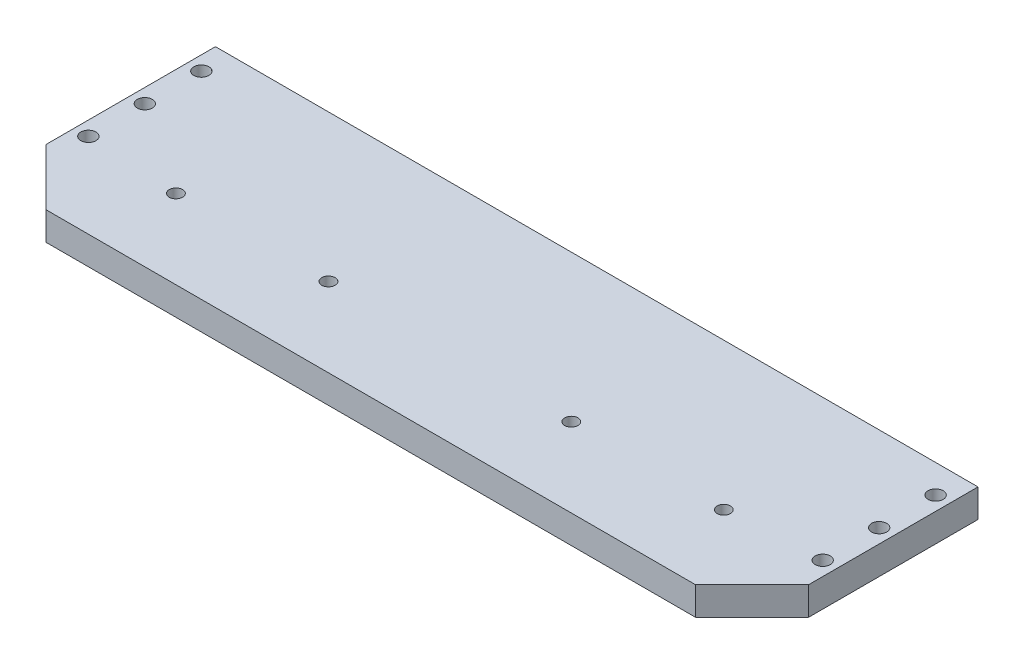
ISO-10303-21;
HEADER;
FILE_DESCRIPTION(('STEP AP214'),'2;1');
FILE_NAME('part.step','',(''),(''),'','','');
FILE_SCHEMA(('AUTOMOTIVE_DESIGN { 1 0 10303 214 1 1 1 1 }'));
ENDSEC;
DATA;
#1=APPLICATION_CONTEXT('core data for automotive mechanical design processes');
#2=APPLICATION_PROTOCOL_DEFINITION('international standard','automotive_design',2000,#1);
#3=PRODUCT_CONTEXT('',#1,'mechanical');
#4=PRODUCT('Part','Part','',(#3));
#5=PRODUCT_RELATED_PRODUCT_CATEGORY('part','',(#4));
#6=PRODUCT_DEFINITION_FORMATION('','',#4);
#7=PRODUCT_DEFINITION_CONTEXT('part definition',#1,'design');
#8=PRODUCT_DEFINITION('design','',#6,#7);
#9=PRODUCT_DEFINITION_SHAPE('','',#8);
#10=(LENGTH_UNIT() NAMED_UNIT(*) SI_UNIT(.MILLI.,.METRE.));
#11=(NAMED_UNIT(*) PLANE_ANGLE_UNIT() SI_UNIT($,.RADIAN.));
#12=(NAMED_UNIT(*) SI_UNIT($,.STERADIAN.) SOLID_ANGLE_UNIT());
#13=UNCERTAINTY_MEASURE_WITH_UNIT(LENGTH_MEASURE(1.E-05),#10,'distance_accuracy_value','');
#14=(GEOMETRIC_REPRESENTATION_CONTEXT(3) GLOBAL_UNCERTAINTY_ASSIGNED_CONTEXT((#13)) GLOBAL_UNIT_ASSIGNED_CONTEXT((#10,
#11,#12)) REPRESENTATION_CONTEXT('',''));
#15=CARTESIAN_POINT('',(0.,0.,0.));
#16=DIRECTION('',(0.,0.,1.));
#17=DIRECTION('',(1.,0.,0.));
#18=AXIS2_PLACEMENT_3D('',#15,#16,#17);
#19=CARTESIAN_POINT('',(-32.525054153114,279.4,50.8));
#20=DIRECTION('',(-1.,0.,0.));
#21=DIRECTION('',(0.,-1.,0.));
#22=AXIS2_PLACEMENT_3D('',#19,#20,#21);
#23=PLANE('',#22);
#24=DIRECTION('',(0.,0.,-1.));
#25=VECTOR('',#24,1.);
#26=CARTESIAN_POINT('',(-32.525054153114,279.4,50.8));
#27=LINE('',#26,#25);
#28=CARTESIAN_POINT('',(-32.525054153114,279.4,38.1));
#29=VERTEX_POINT('',#28);
#30=CARTESIAN_POINT('',(-32.525054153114,279.4,0.));
#31=VERTEX_POINT('',#30);
#32=EDGE_CURVE('E84',#29,#31,#27,.T.);
#33=ORIENTED_EDGE('',*,*,#32,.F.);
#34=DIRECTION('',(0.,-1.,0.));
#35=VECTOR('',#34,1.);
#36=CARTESIAN_POINT('',(-32.525054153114,279.4,38.1));
#37=LINE('',#36,#35);
#38=CARTESIAN_POINT('',(-32.5250541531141,273.05,38.1));
#39=VERTEX_POINT('',#38);
#40=EDGE_CURVE('E11',#29,#39,#37,.T.);
#41=ORIENTED_EDGE('',*,*,#40,.T.);
#42=DIRECTION('',(0.,0.,-1.));
#43=VECTOR('',#42,1.);
#44=CARTESIAN_POINT('',(-32.5250541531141,273.05,50.8));
#45=LINE('',#44,#43);
#46=CARTESIAN_POINT('',(-32.5250541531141,273.05,0.));
#47=VERTEX_POINT('',#46);
#48=EDGE_CURVE('E104',#39,#47,#45,.T.);
#49=ORIENTED_EDGE('',*,*,#48,.T.);
#50=DIRECTION('',(0.,1.,0.));
#51=VECTOR('',#50,1.);
#52=CARTESIAN_POINT('',(-32.525054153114,279.4,0.));
#53=LINE('',#52,#51);
#54=EDGE_CURVE('E99',#47,#31,#53,.T.);
#55=ORIENTED_EDGE('',*,*,#54,.T.);
#56=EDGE_LOOP('',(#33,#41,#49,#55));
#57=FACE_BOUND('',#56,.T.);
#58=ADVANCED_FACE('F33',(#57),#23,.F.);
#59=CARTESIAN_POINT('',(-32.525054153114,279.4,50.8));
#60=DIRECTION('',(0.,-1.,0.));
#61=DIRECTION('',(0.,0.,-1.));
#62=AXIS2_PLACEMENT_3D('',#59,#60,#61);
#63=PLANE('',#62);
#64=CARTESIAN_POINT('',(-35.7000541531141,279.4,6.34999999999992));
#65=DIRECTION('',(0.,1.,0.));
#66=DIRECTION('',(0.,0.,-1.));
#67=AXIS2_PLACEMENT_3D('',#64,#65,#66);
#68=CIRCLE('',#67,1.7);
#69=CARTESIAN_POINT('',(-35.7000541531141,279.4,8.04999999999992));
#70=VERTEX_POINT('',#69);
#71=EDGE_CURVE('E216',#70,#70,#68,.T.);
#72=ORIENTED_EDGE('',*,*,#71,.F.);
#73=EDGE_LOOP('',(#72));
#74=FACE_BOUND('',#73,.T.);
#75=CARTESIAN_POINT('',(-35.7000541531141,279.4,19.0499999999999));
#76=DIRECTION('',(0.,1.,0.));
#77=DIRECTION('',(0.,0.,-1.));
#78=AXIS2_PLACEMENT_3D('',#75,#76,#77);
#79=CIRCLE('',#78,1.7);
#80=CARTESIAN_POINT('',(-35.7000541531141,279.4,20.7499999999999));
#81=VERTEX_POINT('',#80);
#82=EDGE_CURVE('E218',#81,#81,#79,.T.);
#83=ORIENTED_EDGE('',*,*,#82,.F.);
#84=EDGE_LOOP('',(#83));
#85=FACE_BOUND('',#84,.T.);
#86=CARTESIAN_POINT('',(-35.700054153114,279.4,31.7499999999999));
#87=DIRECTION('',(0.,1.,0.));
#88=DIRECTION('',(0.,0.,1.));
#89=AXIS2_PLACEMENT_3D('',#86,#87,#88);
#90=CIRCLE('',#89,1.7);
#91=CARTESIAN_POINT('',(-35.700054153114,279.4,33.4499999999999));
#92=VERTEX_POINT('',#91);
#93=EDGE_CURVE('E224',#92,#92,#90,.T.);
#94=ORIENTED_EDGE('',*,*,#93,.F.);
#95=EDGE_LOOP('',(#94));
#96=FACE_BOUND('',#95,.T.);
#97=CARTESIAN_POINT('',(-200.800054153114,279.4,31.75));
#98=DIRECTION('',(0.,1.,0.));
#99=DIRECTION('',(0.,0.,-1.));
#100=AXIS2_PLACEMENT_3D('',#97,#98,#99);
#101=CIRCLE('',#100,1.70000000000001);
#102=CARTESIAN_POINT('',(-200.800054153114,279.4,33.45));
#103=VERTEX_POINT('',#102);
#104=EDGE_CURVE('E230',#103,#103,#101,.T.);
#105=ORIENTED_EDGE('',*,*,#104,.F.);
#106=EDGE_LOOP('',(#105));
#107=FACE_BOUND('',#106,.T.);
#108=CARTESIAN_POINT('',(-200.800054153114,279.4,19.05));
#109=DIRECTION('',(0.,1.,0.));
#110=DIRECTION('',(0.,0.,1.));
#111=AXIS2_PLACEMENT_3D('',#108,#109,#110);
#112=CIRCLE('',#111,1.70000000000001);
#113=CARTESIAN_POINT('',(-200.800054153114,279.4,20.75));
#114=VERTEX_POINT('',#113);
#115=EDGE_CURVE('E236',#114,#114,#112,.T.);
#116=ORIENTED_EDGE('',*,*,#115,.F.);
#117=EDGE_LOOP('',(#116));
#118=FACE_BOUND('',#117,.T.);
#119=CARTESIAN_POINT('',(-200.800054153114,279.4,6.34999999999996));
#120=DIRECTION('',(0.,1.,0.));
#121=DIRECTION('',(0.,0.,1.));
#122=AXIS2_PLACEMENT_3D('',#119,#120,#121);
#123=CIRCLE('',#122,1.70000000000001);
#124=CARTESIAN_POINT('',(-200.800054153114,279.4,8.04999999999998));
#125=VERTEX_POINT('',#124);
#126=EDGE_CURVE('E242',#125,#125,#123,.T.);
#127=ORIENTED_EDGE('',*,*,#126,.F.);
#128=EDGE_LOOP('',(#127));
#129=FACE_BOUND('',#128,.T.);
#130=CARTESIAN_POINT('',(-179.845054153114,279.4,33.02));
#131=DIRECTION('',(0.,1.,0.));
#132=DIRECTION('',(0.,0.,1.));
#133=AXIS2_PLACEMENT_3D('',#130,#131,#132);
#134=CIRCLE('',#133,1.5);
#135=CARTESIAN_POINT('',(-179.845054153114,279.4,34.52));
#136=VERTEX_POINT('',#135);
#137=EDGE_CURVE('E248',#136,#136,#134,.T.);
#138=ORIENTED_EDGE('',*,*,#137,.F.);
#139=EDGE_LOOP('',(#138));
#140=FACE_BOUND('',#139,.T.);
#141=CARTESIAN_POINT('',(-145.555054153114,279.4,33.02));
#142=DIRECTION('',(0.,1.,0.));
#143=DIRECTION('',(0.,0.,1.));
#144=AXIS2_PLACEMENT_3D('',#141,#142,#143);
#145=CIRCLE('',#144,1.5);
#146=CARTESIAN_POINT('',(-145.555054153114,279.4,34.52));
#147=VERTEX_POINT('',#146);
#148=EDGE_CURVE('E254',#147,#147,#145,.T.);
#149=ORIENTED_EDGE('',*,*,#148,.F.);
#150=EDGE_LOOP('',(#149));
#151=FACE_BOUND('',#150,.T.);
#152=CARTESIAN_POINT('',(-56.6550541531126,279.4,33.02));
#153=DIRECTION('',(0.,1.,0.));
#154=DIRECTION('',(0.,0.,1.));
#155=AXIS2_PLACEMENT_3D('',#152,#153,#154);
#156=CIRCLE('',#155,1.5);
#157=CARTESIAN_POINT('',(-56.6550541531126,279.4,34.52));
#158=VERTEX_POINT('',#157);
#159=EDGE_CURVE('E260',#158,#158,#156,.T.);
#160=ORIENTED_EDGE('',*,*,#159,.F.);
#161=EDGE_LOOP('',(#160));
#162=FACE_BOUND('',#161,.T.);
#163=CARTESIAN_POINT('',(-90.9450541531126,279.4,33.02));
#164=DIRECTION('',(0.,1.,0.));
#165=DIRECTION('',(0.,0.,1.));
#166=AXIS2_PLACEMENT_3D('',#163,#164,#165);
#167=CIRCLE('',#166,1.5);
#168=CARTESIAN_POINT('',(-90.9450541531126,279.4,34.52));
#169=VERTEX_POINT('',#168);
#170=EDGE_CURVE('E109',#169,#169,#167,.T.);
#171=ORIENTED_EDGE('',*,*,#170,.F.);
#172=EDGE_LOOP('',(#171));
#173=FACE_BOUND('',#172,.T.);
#174=DIRECTION('',(0.,0.,-1.));
#175=VECTOR('',#174,1.);
#176=CARTESIAN_POINT('',(-203.975054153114,279.4,50.8));
#177=LINE('',#176,#175);
#178=CARTESIAN_POINT('',(-203.975054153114,279.4,38.0999999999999));
#179=VERTEX_POINT('',#178);
#180=CARTESIAN_POINT('',(-203.975054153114,279.4,0.));
#181=VERTEX_POINT('',#180);
#182=EDGE_CURVE('E93',#179,#181,#177,.T.);
#183=ORIENTED_EDGE('',*,*,#182,.F.);
#184=DIRECTION('',(-0.707106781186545,0.,-0.70710678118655));
#185=VECTOR('',#184,1.);
#186=CARTESIAN_POINT('',(-191.275054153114,279.4,50.8));
#187=LINE('',#186,#185);
#188=CARTESIAN_POINT('',(-191.275054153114,279.4,50.8));
#189=VERTEX_POINT('',#188);
#190=EDGE_CURVE('E41',#179,#189,#187,.F.);
#191=ORIENTED_EDGE('',*,*,#190,.T.);
#192=DIRECTION('',(-1.,0.,0.));
#193=VECTOR('',#192,1.);
#194=CARTESIAN_POINT('',(-32.525054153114,279.4,50.8));
#195=LINE('',#194,#193);
#196=CARTESIAN_POINT('',(-45.225054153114,279.4,50.8));
#197=VERTEX_POINT('',#196);
#198=EDGE_CURVE('E118',#197,#189,#195,.T.);
#199=ORIENTED_EDGE('',*,*,#198,.F.);
#200=DIRECTION('',(-0.707106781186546,0.,0.707106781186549));
#201=VECTOR('',#200,1.);
#202=CARTESIAN_POINT('',(-45.2250541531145,279.4,50.8000000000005));
#203=LINE('',#202,#201);
#204=EDGE_CURVE('E48',#197,#29,#203,.F.);
#205=ORIENTED_EDGE('',*,*,#204,.T.);
#206=ORIENTED_EDGE('',*,*,#32,.T.);
#207=DIRECTION('',(-1.,0.,0.));
#208=VECTOR('',#207,1.);
#209=CARTESIAN_POINT('',(-32.525054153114,279.4,0.));
#210=LINE('',#209,#208);
#211=EDGE_CURVE('E87',#31,#181,#210,.T.);
#212=ORIENTED_EDGE('',*,*,#211,.T.);
#213=EDGE_LOOP('',(#183,#191,#199,#205,#206,#212));
#214=FACE_BOUND('',#213,.T.);
#215=ADVANCED_FACE('F86',(#74,#85,#96,#107,#118,#129,#140,#151,#162,#173,#214),#63,.F.);
#216=CARTESIAN_POINT('',(-203.975054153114,279.4,50.8));
#217=DIRECTION('',(1.,0.,0.));
#218=DIRECTION('',(0.,0.,-1.));
#219=AXIS2_PLACEMENT_3D('',#216,#217,#218);
#220=PLANE('',#219);
#221=DIRECTION('',(0.,0.,-1.));
#222=VECTOR('',#221,1.);
#223=CARTESIAN_POINT('',(-203.975054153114,273.05,50.8));
#224=LINE('',#223,#222);
#225=CARTESIAN_POINT('',(-203.975054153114,273.05,38.0999999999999));
#226=VERTEX_POINT('',#225);
#227=CARTESIAN_POINT('',(-203.975054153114,273.05,0.));
#228=VERTEX_POINT('',#227);
#229=EDGE_CURVE('E120',#226,#228,#224,.T.);
#230=ORIENTED_EDGE('',*,*,#229,.F.);
#231=DIRECTION('',(0.,1.,0.));
#232=VECTOR('',#231,1.);
#233=CARTESIAN_POINT('',(-203.975054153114,279.4,38.0999999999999));
#234=LINE('',#233,#232);
#235=EDGE_CURVE('E56',#226,#179,#234,.T.);
#236=ORIENTED_EDGE('',*,*,#235,.T.);
#237=ORIENTED_EDGE('',*,*,#182,.T.);
#238=DIRECTION('',(0.,-1.,0.));
#239=VECTOR('',#238,1.);
#240=CARTESIAN_POINT('',(-203.975054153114,279.4,0.));
#241=LINE('',#240,#239);
#242=EDGE_CURVE('E101',#181,#228,#241,.T.);
#243=ORIENTED_EDGE('',*,*,#242,.T.);
#244=EDGE_LOOP('',(#230,#236,#237,#243));
#245=FACE_BOUND('',#244,.T.);
#246=ADVANCED_FACE('F145',(#245),#220,.F.);
#247=CARTESIAN_POINT('',(-32.5250541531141,273.05,50.8));
#248=DIRECTION('',(0.,1.,0.));
#249=DIRECTION('',(0.,0.,1.));
#250=AXIS2_PLACEMENT_3D('',#247,#248,#249);
#251=PLANE('',#250);
#252=CARTESIAN_POINT('',(-35.7000541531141,273.05,6.34999999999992));
#253=DIRECTION('',(0.,1.,0.));
#254=DIRECTION('',(0.,0.,-1.));
#255=AXIS2_PLACEMENT_3D('',#252,#253,#254);
#256=CIRCLE('',#255,1.7);
#257=CARTESIAN_POINT('',(-35.7000541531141,273.05,8.04999999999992));
#258=VERTEX_POINT('',#257);
#259=EDGE_CURVE('E213',#258,#258,#256,.T.);
#260=ORIENTED_EDGE('',*,*,#259,.T.);
#261=EDGE_LOOP('',(#260));
#262=FACE_BOUND('',#261,.T.);
#263=CARTESIAN_POINT('',(-35.7000541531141,273.05,19.0499999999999));
#264=DIRECTION('',(0.,1.,0.));
#265=DIRECTION('',(0.,0.,-1.));
#266=AXIS2_PLACEMENT_3D('',#263,#264,#265);
#267=CIRCLE('',#266,1.7);
#268=CARTESIAN_POINT('',(-35.7000541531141,273.05,20.7499999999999));
#269=VERTEX_POINT('',#268);
#270=EDGE_CURVE('E221',#269,#269,#267,.T.);
#271=ORIENTED_EDGE('',*,*,#270,.T.);
#272=EDGE_LOOP('',(#271));
#273=FACE_BOUND('',#272,.T.);
#274=CARTESIAN_POINT('',(-35.700054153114,273.05,31.7499999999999));
#275=DIRECTION('',(0.,1.,0.));
#276=DIRECTION('',(0.,0.,1.));
#277=AXIS2_PLACEMENT_3D('',#274,#275,#276);
#278=CIRCLE('',#277,1.7);
#279=CARTESIAN_POINT('',(-35.700054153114,273.05,33.4499999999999));
#280=VERTEX_POINT('',#279);
#281=EDGE_CURVE('E227',#280,#280,#278,.T.);
#282=ORIENTED_EDGE('',*,*,#281,.T.);
#283=EDGE_LOOP('',(#282));
#284=FACE_BOUND('',#283,.T.);
#285=CARTESIAN_POINT('',(-200.800054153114,273.05,31.75));
#286=DIRECTION('',(0.,1.,0.));
#287=DIRECTION('',(0.,0.,-1.));
#288=AXIS2_PLACEMENT_3D('',#285,#286,#287);
#289=CIRCLE('',#288,1.70000000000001);
#290=CARTESIAN_POINT('',(-200.800054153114,273.05,33.45));
#291=VERTEX_POINT('',#290);
#292=EDGE_CURVE('E233',#291,#291,#289,.T.);
#293=ORIENTED_EDGE('',*,*,#292,.T.);
#294=EDGE_LOOP('',(#293));
#295=FACE_BOUND('',#294,.T.);
#296=CARTESIAN_POINT('',(-200.800054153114,273.05,19.05));
#297=DIRECTION('',(0.,1.,0.));
#298=DIRECTION('',(0.,0.,1.));
#299=AXIS2_PLACEMENT_3D('',#296,#297,#298);
#300=CIRCLE('',#299,1.70000000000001);
#301=CARTESIAN_POINT('',(-200.800054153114,273.05,20.75));
#302=VERTEX_POINT('',#301);
#303=EDGE_CURVE('E239',#302,#302,#300,.T.);
#304=ORIENTED_EDGE('',*,*,#303,.T.);
#305=EDGE_LOOP('',(#304));
#306=FACE_BOUND('',#305,.T.);
#307=CARTESIAN_POINT('',(-200.800054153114,273.05,6.34999999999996));
#308=DIRECTION('',(0.,1.,0.));
#309=DIRECTION('',(0.,0.,1.));
#310=AXIS2_PLACEMENT_3D('',#307,#308,#309);
#311=CIRCLE('',#310,1.70000000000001);
#312=CARTESIAN_POINT('',(-200.800054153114,273.05,8.04999999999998));
#313=VERTEX_POINT('',#312);
#314=EDGE_CURVE('E245',#313,#313,#311,.T.);
#315=ORIENTED_EDGE('',*,*,#314,.T.);
#316=EDGE_LOOP('',(#315));
#317=FACE_BOUND('',#316,.T.);
#318=CARTESIAN_POINT('',(-179.845054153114,273.05,33.02));
#319=DIRECTION('',(0.,1.,0.));
#320=DIRECTION('',(0.,0.,1.));
#321=AXIS2_PLACEMENT_3D('',#318,#319,#320);
#322=CIRCLE('',#321,1.5);
#323=CARTESIAN_POINT('',(-179.845054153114,273.05,34.52));
#324=VERTEX_POINT('',#323);
#325=EDGE_CURVE('E251',#324,#324,#322,.T.);
#326=ORIENTED_EDGE('',*,*,#325,.T.);
#327=EDGE_LOOP('',(#326));
#328=FACE_BOUND('',#327,.T.);
#329=CARTESIAN_POINT('',(-145.555054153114,273.05,33.02));
#330=DIRECTION('',(0.,1.,0.));
#331=DIRECTION('',(0.,0.,1.));
#332=AXIS2_PLACEMENT_3D('',#329,#330,#331);
#333=CIRCLE('',#332,1.5);
#334=CARTESIAN_POINT('',(-145.555054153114,273.05,34.52));
#335=VERTEX_POINT('',#334);
#336=EDGE_CURVE('E257',#335,#335,#333,.T.);
#337=ORIENTED_EDGE('',*,*,#336,.T.);
#338=EDGE_LOOP('',(#337));
#339=FACE_BOUND('',#338,.T.);
#340=CARTESIAN_POINT('',(-56.6550541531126,273.05,33.02));
#341=DIRECTION('',(0.,1.,0.));
#342=DIRECTION('',(0.,0.,1.));
#343=AXIS2_PLACEMENT_3D('',#340,#341,#342);
#344=CIRCLE('',#343,1.5);
#345=CARTESIAN_POINT('',(-56.6550541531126,273.05,34.52));
#346=VERTEX_POINT('',#345);
#347=EDGE_CURVE('E263',#346,#346,#344,.T.);
#348=ORIENTED_EDGE('',*,*,#347,.T.);
#349=EDGE_LOOP('',(#348));
#350=FACE_BOUND('',#349,.T.);
#351=CARTESIAN_POINT('',(-90.9450541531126,273.05,33.02));
#352=DIRECTION('',(0.,1.,0.));
#353=DIRECTION('',(0.,0.,1.));
#354=AXIS2_PLACEMENT_3D('',#351,#352,#353);
#355=CIRCLE('',#354,1.5);
#356=CARTESIAN_POINT('',(-90.9450541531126,273.05,34.52));
#357=VERTEX_POINT('',#356);
#358=EDGE_CURVE('E106',#357,#357,#355,.T.);
#359=ORIENTED_EDGE('',*,*,#358,.T.);
#360=EDGE_LOOP('',(#359));
#361=FACE_BOUND('',#360,.T.);
#362=DIRECTION('',(1.,0.,0.));
#363=VECTOR('',#362,1.);
#364=CARTESIAN_POINT('',(-32.5250541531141,273.05,50.8));
#365=LINE('',#364,#363);
#366=CARTESIAN_POINT('',(-191.275054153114,273.05,50.8));
#367=VERTEX_POINT('',#366);
#368=CARTESIAN_POINT('',(-45.2250541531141,273.05,50.8));
#369=VERTEX_POINT('',#368);
#370=EDGE_CURVE('E112',#367,#369,#365,.T.);
#371=ORIENTED_EDGE('',*,*,#370,.F.);
#372=DIRECTION('',(0.707106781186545,0.,0.70710678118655));
#373=VECTOR('',#372,1.);
#374=CARTESIAN_POINT('',(-191.275054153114,273.05,50.8));
#375=LINE('',#374,#373);
#376=EDGE_CURVE('E130',#367,#226,#375,.F.);
#377=ORIENTED_EDGE('',*,*,#376,.T.);
#378=ORIENTED_EDGE('',*,*,#229,.T.);
#379=DIRECTION('',(1.,0.,0.));
#380=VECTOR('',#379,1.);
#381=CARTESIAN_POINT('',(-32.5250541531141,273.05,0.));
#382=LINE('',#381,#380);
#383=EDGE_CURVE('E116',#228,#47,#382,.T.);
#384=ORIENTED_EDGE('',*,*,#383,.T.);
#385=ORIENTED_EDGE('',*,*,#48,.F.);
#386=DIRECTION('',(0.707106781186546,0.,-0.707106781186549));
#387=VECTOR('',#386,1.);
#388=CARTESIAN_POINT('',(-45.2250541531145,273.05,50.8000000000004));
#389=LINE('',#388,#387);
#390=EDGE_CURVE('E128',#39,#369,#389,.F.);
#391=ORIENTED_EDGE('',*,*,#390,.T.);
#392=EDGE_LOOP('',(#371,#377,#378,#384,#385,#391));
#393=FACE_BOUND('',#392,.T.);
#394=ADVANCED_FACE('F144',(#262,#273,#284,#295,#306,#317,#328,#339,#350,#361,#393),#251,.F.);
#395=CARTESIAN_POINT('',(0.,0.,50.8));
#396=DIRECTION('',(0.,0.,-1.));
#397=DIRECTION('',(-1.,0.,0.));
#398=AXIS2_PLACEMENT_3D('',#395,#396,#397);
#399=PLANE('',#398);
#400=ORIENTED_EDGE('',*,*,#198,.T.);
#401=DIRECTION('',(0.,-1.,0.));
#402=VECTOR('',#401,1.);
#403=CARTESIAN_POINT('',(-191.275054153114,0.,50.8));
#404=LINE('',#403,#402);
#405=EDGE_CURVE('E125',#189,#367,#404,.T.);
#406=ORIENTED_EDGE('',*,*,#405,.T.);
#407=ORIENTED_EDGE('',*,*,#370,.T.);
#408=DIRECTION('',(0.,1.,0.));
#409=VECTOR('',#408,1.);
#410=CARTESIAN_POINT('',(-45.225054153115,1.48257568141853E-13,50.8));
#411=LINE('',#410,#409);
#412=EDGE_CURVE('E92',#369,#197,#411,.T.);
#413=ORIENTED_EDGE('',*,*,#412,.T.);
#414=EDGE_LOOP('',(#400,#406,#407,#413));
#415=FACE_BOUND('',#414,.T.);
#416=ADVANCED_FACE('F138',(#415),#399,.F.);
#417=CARTESIAN_POINT('',(0.,0.,0.));
#418=DIRECTION('',(0.,0.,-1.));
#419=DIRECTION('',(-1.,0.,0.));
#420=AXIS2_PLACEMENT_3D('',#417,#418,#419);
#421=PLANE('',#420);
#422=ORIENTED_EDGE('',*,*,#54,.F.);
#423=ORIENTED_EDGE('',*,*,#383,.F.);
#424=ORIENTED_EDGE('',*,*,#242,.F.);
#425=ORIENTED_EDGE('',*,*,#211,.F.);
#426=EDGE_LOOP('',(#422,#423,#424,#425));
#427=FACE_BOUND('',#426,.T.);
#428=ADVANCED_FACE('F97',(#427),#421,.T.);
#429=CARTESIAN_POINT('',(-191.275054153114,0.,50.8));
#430=DIRECTION('',(0.70710678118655,0.,-0.707106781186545));
#431=DIRECTION('',(0.,-1.,0.));
#432=AXIS2_PLACEMENT_3D('',#429,#430,#431);
#433=PLANE('',#432);
#434=ORIENTED_EDGE('',*,*,#190,.F.);
#435=ORIENTED_EDGE('',*,*,#235,.F.);
#436=ORIENTED_EDGE('',*,*,#376,.F.);
#437=ORIENTED_EDGE('',*,*,#405,.F.);
#438=EDGE_LOOP('',(#434,#435,#436,#437));
#439=FACE_BOUND('',#438,.T.);
#440=ADVANCED_FACE('F142',(#439),#433,.F.);
#441=CARTESIAN_POINT('',(-45.225054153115,1.48257568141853E-13,50.8));
#442=DIRECTION('',(-0.707106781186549,0.,-0.707106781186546));
#443=DIRECTION('',(0.,1.,0.));
#444=AXIS2_PLACEMENT_3D('',#441,#442,#443);
#445=PLANE('',#444);
#446=ORIENTED_EDGE('',*,*,#390,.F.);
#447=ORIENTED_EDGE('',*,*,#40,.F.);
#448=ORIENTED_EDGE('',*,*,#204,.F.);
#449=ORIENTED_EDGE('',*,*,#412,.F.);
#450=EDGE_LOOP('',(#446,#447,#448,#449));
#451=FACE_BOUND('',#450,.T.);
#452=ADVANCED_FACE('F35',(#451),#445,.F.);
#453=CARTESIAN_POINT('',(-90.9450541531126,273.05,33.02));
#454=DIRECTION('',(0.,1.,0.));
#455=DIRECTION('',(0.,0.,1.));
#456=AXIS2_PLACEMENT_3D('',#453,#454,#455);
#457=CYLINDRICAL_SURFACE('',#456,1.5);
#458=CARTESIAN_POINT('',(-90.9450541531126,273.05,34.52));
#459=CARTESIAN_POINT('',(-90.9450541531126,273.116145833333,34.52));
#460=CARTESIAN_POINT('',(-90.9450541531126,273.182291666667,34.52));
#461=CARTESIAN_POINT('',(-90.9450541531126,273.314583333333,34.52));
#462=CARTESIAN_POINT('',(-90.9450541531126,273.380729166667,34.52));
#463=CARTESIAN_POINT('',(-90.9450541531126,273.513020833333,34.52));
#464=CARTESIAN_POINT('',(-90.9450541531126,273.579166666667,34.52));
#465=CARTESIAN_POINT('',(-90.9450541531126,273.711458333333,34.52));
#466=CARTESIAN_POINT('',(-90.9450541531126,273.777604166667,34.52));
#467=CARTESIAN_POINT('',(-90.9450541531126,273.909895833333,34.52));
#468=CARTESIAN_POINT('',(-90.9450541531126,273.976041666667,34.52));
#469=CARTESIAN_POINT('',(-90.9450541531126,274.108333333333,34.52));
#470=CARTESIAN_POINT('',(-90.9450541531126,274.174479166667,34.52));
#471=CARTESIAN_POINT('',(-90.9450541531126,274.306770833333,34.52));
#472=CARTESIAN_POINT('',(-90.9450541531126,274.372916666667,34.52));
#473=CARTESIAN_POINT('',(-90.9450541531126,274.505208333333,34.52));
#474=CARTESIAN_POINT('',(-90.9450541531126,274.571354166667,34.52));
#475=CARTESIAN_POINT('',(-90.9450541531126,274.703645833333,34.52));
#476=CARTESIAN_POINT('',(-90.9450541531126,274.769791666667,34.52));
#477=CARTESIAN_POINT('',(-90.9450541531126,274.902083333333,34.52));
#478=CARTESIAN_POINT('',(-90.9450541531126,274.968229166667,34.52));
#479=CARTESIAN_POINT('',(-90.9450541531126,275.100520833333,34.52));
#480=CARTESIAN_POINT('',(-90.9450541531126,275.166666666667,34.52));
#481=CARTESIAN_POINT('',(-90.9450541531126,275.298958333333,34.52));
#482=CARTESIAN_POINT('',(-90.9450541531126,275.365104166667,34.52));
#483=CARTESIAN_POINT('',(-90.9450541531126,275.497395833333,34.52));
#484=CARTESIAN_POINT('',(-90.9450541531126,275.563541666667,34.52));
#485=CARTESIAN_POINT('',(-90.9450541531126,275.695833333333,34.52));
#486=CARTESIAN_POINT('',(-90.9450541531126,275.761979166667,34.52));
#487=CARTESIAN_POINT('',(-90.9450541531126,275.894270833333,34.52));
#488=CARTESIAN_POINT('',(-90.9450541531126,275.960416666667,34.52));
#489=CARTESIAN_POINT('',(-90.9450541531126,276.092708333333,34.52));
#490=CARTESIAN_POINT('',(-90.9450541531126,276.158854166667,34.52));
#491=CARTESIAN_POINT('',(-90.9450541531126,276.291145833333,34.52));
#492=CARTESIAN_POINT('',(-90.9450541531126,276.357291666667,34.52));
#493=CARTESIAN_POINT('',(-90.9450541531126,276.489583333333,34.52));
#494=CARTESIAN_POINT('',(-90.9450541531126,276.555729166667,34.52));
#495=CARTESIAN_POINT('',(-90.9450541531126,276.688020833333,34.52));
#496=CARTESIAN_POINT('',(-90.9450541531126,276.754166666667,34.52));
#497=CARTESIAN_POINT('',(-90.9450541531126,276.886458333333,34.52));
#498=CARTESIAN_POINT('',(-90.9450541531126,276.952604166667,34.52));
#499=CARTESIAN_POINT('',(-90.9450541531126,277.084895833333,34.52));
#500=CARTESIAN_POINT('',(-90.9450541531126,277.151041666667,34.52));
#501=CARTESIAN_POINT('',(-90.9450541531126,277.283333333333,34.52));
#502=CARTESIAN_POINT('',(-90.9450541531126,277.349479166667,34.52));
#503=CARTESIAN_POINT('',(-90.9450541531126,277.481770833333,34.52));
#504=CARTESIAN_POINT('',(-90.9450541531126,277.547916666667,34.52));
#505=CARTESIAN_POINT('',(-90.9450541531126,277.680208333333,34.52));
#506=CARTESIAN_POINT('',(-90.9450541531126,277.746354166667,34.52));
#507=CARTESIAN_POINT('',(-90.9450541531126,277.878645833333,34.52));
#508=CARTESIAN_POINT('',(-90.9450541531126,277.944791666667,34.52));
#509=CARTESIAN_POINT('',(-90.9450541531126,278.077083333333,34.52));
#510=CARTESIAN_POINT('',(-90.9450541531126,278.143229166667,34.52));
#511=CARTESIAN_POINT('',(-90.9450541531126,278.275520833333,34.52));
#512=CARTESIAN_POINT('',(-90.9450541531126,278.341666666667,34.52));
#513=CARTESIAN_POINT('',(-90.9450541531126,278.473958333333,34.52));
#514=CARTESIAN_POINT('',(-90.9450541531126,278.540104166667,34.52));
#515=CARTESIAN_POINT('',(-90.9450541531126,278.672395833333,34.52));
#516=CARTESIAN_POINT('',(-90.9450541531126,278.738541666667,34.52));
#517=CARTESIAN_POINT('',(-90.9450541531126,278.870833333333,34.52));
#518=CARTESIAN_POINT('',(-90.9450541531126,278.936979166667,34.52));
#519=CARTESIAN_POINT('',(-90.9450541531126,279.069270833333,34.52));
#520=CARTESIAN_POINT('',(-90.9450541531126,279.135416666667,34.52));
#521=CARTESIAN_POINT('',(-90.9450541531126,279.267708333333,34.52));
#522=CARTESIAN_POINT('',(-90.9450541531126,279.333854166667,34.52));
#523=CARTESIAN_POINT('',(-90.9450541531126,279.4,34.52));
#524=B_SPLINE_CURVE_WITH_KNOTS('',3,(#458,#459,#460,#461,#462,#463,#464,#465,#466,#467,#468,
#469,#470,#471,#472,#473,#474,#475,#476,#477,#478,#479,#480,#481,#482,#483,#484,#485,#486,#487,
#488,#489,#490,#491,#492,#493,#494,#495,#496,#497,#498,#499,#500,#501,#502,#503,#504,#505,#506,
#507,#508,#509,#510,#511,#512,#513,#514,#515,#516,#517,#518,#519,#520,#521,#522,#523),
.UNSPECIFIED.,.F.,.F.,(4,2,2,2,2,2,2,2,2,2,2,2,2,2,2,2,2,2,2,2,2,2,2,2,2,2,2,2,2,2,2,2,4),(0.,
0.198437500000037,0.396875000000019,0.595312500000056,0.793750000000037,0.992187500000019,
1.19062500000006,1.38906250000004,1.58750000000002,1.78593750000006,1.98437500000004,
2.18281250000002,2.38125000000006,2.57968750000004,2.77812500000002,2.97656250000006,
3.17500000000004,3.37343750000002,3.57187500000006,3.77031250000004,3.96875000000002,
4.16718750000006,4.36562500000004,4.56406250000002,4.76250000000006,4.96093750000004,
5.15937500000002,5.35781250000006,5.55625000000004,5.75468750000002,5.95312500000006,
6.15156250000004,6.35000000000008),.UNSPECIFIED.);
#525=EDGE_CURVE('BSEAM149',#357,#169,#524,.T.);
#526=ORIENTED_EDGE('',*,*,#358,.F.);
#527=ORIENTED_EDGE('',*,*,#170,.T.);
#528=ORIENTED_EDGE('',*,*,#525,.T.);
#529=ORIENTED_EDGE('',*,*,#525,.F.);
#530=EDGE_LOOP('',(#526,#528,#527,#529));
#531=FACE_BOUND('',#530,.T.);
#532=ADVANCED_FACE('F149',(#531),#457,.F.);
#533=CARTESIAN_POINT('',(-56.6550541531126,273.05,33.02));
#534=DIRECTION('',(0.,1.,0.));
#535=DIRECTION('',(0.,0.,1.));
#536=AXIS2_PLACEMENT_3D('',#533,#534,#535);
#537=CYLINDRICAL_SURFACE('',#536,1.5);
#538=CARTESIAN_POINT('',(-56.6550541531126,273.05,34.52));
#539=CARTESIAN_POINT('',(-56.6550541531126,273.116145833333,34.52));
#540=CARTESIAN_POINT('',(-56.6550541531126,273.182291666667,34.52));
#541=CARTESIAN_POINT('',(-56.6550541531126,273.314583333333,34.52));
#542=CARTESIAN_POINT('',(-56.6550541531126,273.380729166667,34.52));
#543=CARTESIAN_POINT('',(-56.6550541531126,273.513020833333,34.52));
#544=CARTESIAN_POINT('',(-56.6550541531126,273.579166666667,34.52));
#545=CARTESIAN_POINT('',(-56.6550541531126,273.711458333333,34.52));
#546=CARTESIAN_POINT('',(-56.6550541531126,273.777604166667,34.52));
#547=CARTESIAN_POINT('',(-56.6550541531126,273.909895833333,34.52));
#548=CARTESIAN_POINT('',(-56.6550541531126,273.976041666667,34.52));
#549=CARTESIAN_POINT('',(-56.6550541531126,274.108333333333,34.52));
#550=CARTESIAN_POINT('',(-56.6550541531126,274.174479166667,34.52));
#551=CARTESIAN_POINT('',(-56.6550541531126,274.306770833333,34.52));
#552=CARTESIAN_POINT('',(-56.6550541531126,274.372916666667,34.52));
#553=CARTESIAN_POINT('',(-56.6550541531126,274.505208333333,34.52));
#554=CARTESIAN_POINT('',(-56.6550541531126,274.571354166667,34.52));
#555=CARTESIAN_POINT('',(-56.6550541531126,274.703645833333,34.52));
#556=CARTESIAN_POINT('',(-56.6550541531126,274.769791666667,34.52));
#557=CARTESIAN_POINT('',(-56.6550541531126,274.902083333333,34.52));
#558=CARTESIAN_POINT('',(-56.6550541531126,274.968229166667,34.52));
#559=CARTESIAN_POINT('',(-56.6550541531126,275.100520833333,34.52));
#560=CARTESIAN_POINT('',(-56.6550541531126,275.166666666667,34.52));
#561=CARTESIAN_POINT('',(-56.6550541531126,275.298958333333,34.52));
#562=CARTESIAN_POINT('',(-56.6550541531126,275.365104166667,34.52));
#563=CARTESIAN_POINT('',(-56.6550541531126,275.497395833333,34.52));
#564=CARTESIAN_POINT('',(-56.6550541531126,275.563541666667,34.52));
#565=CARTESIAN_POINT('',(-56.6550541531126,275.695833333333,34.52));
#566=CARTESIAN_POINT('',(-56.6550541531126,275.761979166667,34.52));
#567=CARTESIAN_POINT('',(-56.6550541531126,275.894270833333,34.52));
#568=CARTESIAN_POINT('',(-56.6550541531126,275.960416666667,34.52));
#569=CARTESIAN_POINT('',(-56.6550541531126,276.092708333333,34.52));
#570=CARTESIAN_POINT('',(-56.6550541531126,276.158854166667,34.52));
#571=CARTESIAN_POINT('',(-56.6550541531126,276.291145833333,34.52));
#572=CARTESIAN_POINT('',(-56.6550541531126,276.357291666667,34.52));
#573=CARTESIAN_POINT('',(-56.6550541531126,276.489583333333,34.52));
#574=CARTESIAN_POINT('',(-56.6550541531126,276.555729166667,34.52));
#575=CARTESIAN_POINT('',(-56.6550541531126,276.688020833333,34.52));
#576=CARTESIAN_POINT('',(-56.6550541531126,276.754166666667,34.52));
#577=CARTESIAN_POINT('',(-56.6550541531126,276.886458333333,34.52));
#578=CARTESIAN_POINT('',(-56.6550541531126,276.952604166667,34.52));
#579=CARTESIAN_POINT('',(-56.6550541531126,277.084895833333,34.52));
#580=CARTESIAN_POINT('',(-56.6550541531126,277.151041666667,34.52));
#581=CARTESIAN_POINT('',(-56.6550541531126,277.283333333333,34.52));
#582=CARTESIAN_POINT('',(-56.6550541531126,277.349479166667,34.52));
#583=CARTESIAN_POINT('',(-56.6550541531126,277.481770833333,34.52));
#584=CARTESIAN_POINT('',(-56.6550541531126,277.547916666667,34.52));
#585=CARTESIAN_POINT('',(-56.6550541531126,277.680208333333,34.52));
#586=CARTESIAN_POINT('',(-56.6550541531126,277.746354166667,34.52));
#587=CARTESIAN_POINT('',(-56.6550541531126,277.878645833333,34.52));
#588=CARTESIAN_POINT('',(-56.6550541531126,277.944791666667,34.52));
#589=CARTESIAN_POINT('',(-56.6550541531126,278.077083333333,34.52));
#590=CARTESIAN_POINT('',(-56.6550541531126,278.143229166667,34.52));
#591=CARTESIAN_POINT('',(-56.6550541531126,278.275520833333,34.52));
#592=CARTESIAN_POINT('',(-56.6550541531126,278.341666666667,34.52));
#593=CARTESIAN_POINT('',(-56.6550541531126,278.473958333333,34.52));
#594=CARTESIAN_POINT('',(-56.6550541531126,278.540104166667,34.52));
#595=CARTESIAN_POINT('',(-56.6550541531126,278.672395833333,34.52));
#596=CARTESIAN_POINT('',(-56.6550541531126,278.738541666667,34.52));
#597=CARTESIAN_POINT('',(-56.6550541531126,278.870833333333,34.52));
#598=CARTESIAN_POINT('',(-56.6550541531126,278.936979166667,34.52));
#599=CARTESIAN_POINT('',(-56.6550541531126,279.069270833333,34.52));
#600=CARTESIAN_POINT('',(-56.6550541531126,279.135416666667,34.52));
#601=CARTESIAN_POINT('',(-56.6550541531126,279.267708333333,34.52));
#602=CARTESIAN_POINT('',(-56.6550541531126,279.333854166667,34.52));
#603=CARTESIAN_POINT('',(-56.6550541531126,279.4,34.52));
#604=B_SPLINE_CURVE_WITH_KNOTS('',3,(#538,#539,#540,#541,#542,#543,#544,#545,#546,#547,#548,
#549,#550,#551,#552,#553,#554,#555,#556,#557,#558,#559,#560,#561,#562,#563,#564,#565,#566,#567,
#568,#569,#570,#571,#572,#573,#574,#575,#576,#577,#578,#579,#580,#581,#582,#583,#584,#585,#586,
#587,#588,#589,#590,#591,#592,#593,#594,#595,#596,#597,#598,#599,#600,#601,#602,#603),
.UNSPECIFIED.,.F.,.F.,(4,2,2,2,2,2,2,2,2,2,2,2,2,2,2,2,2,2,2,2,2,2,2,2,2,2,2,2,2,2,2,2,4),(0.,
0.198437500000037,0.396875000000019,0.595312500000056,0.793750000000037,0.992187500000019,
1.19062500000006,1.38906250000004,1.58750000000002,1.78593750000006,1.98437500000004,
2.18281250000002,2.38125000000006,2.57968750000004,2.77812500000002,2.97656250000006,
3.17500000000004,3.37343750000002,3.57187500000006,3.77031250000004,3.96875000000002,
4.16718750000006,4.36562500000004,4.56406250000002,4.76250000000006,4.96093750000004,
5.15937500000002,5.35781250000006,5.55625000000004,5.75468750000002,5.95312500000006,
6.15156250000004,6.35000000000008),.UNSPECIFIED.);
#605=EDGE_CURVE('BSEAM154',#346,#158,#604,.T.);
#606=ORIENTED_EDGE('',*,*,#347,.F.);
#607=ORIENTED_EDGE('',*,*,#159,.T.);
#608=ORIENTED_EDGE('',*,*,#605,.T.);
#609=ORIENTED_EDGE('',*,*,#605,.F.);
#610=EDGE_LOOP('',(#606,#608,#607,#609));
#611=FACE_BOUND('',#610,.T.);
#612=ADVANCED_FACE('F154',(#611),#537,.F.);
#613=CARTESIAN_POINT('',(-145.555054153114,273.05,33.02));
#614=DIRECTION('',(0.,1.,0.));
#615=DIRECTION('',(0.,0.,1.));
#616=AXIS2_PLACEMENT_3D('',#613,#614,#615);
#617=CYLINDRICAL_SURFACE('',#616,1.5);
#618=CARTESIAN_POINT('',(-145.555054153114,273.05,34.52));
#619=CARTESIAN_POINT('',(-145.555054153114,273.116145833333,34.52));
#620=CARTESIAN_POINT('',(-145.555054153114,273.182291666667,34.52));
#621=CARTESIAN_POINT('',(-145.555054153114,273.314583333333,34.52));
#622=CARTESIAN_POINT('',(-145.555054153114,273.380729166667,34.52));
#623=CARTESIAN_POINT('',(-145.555054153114,273.513020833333,34.52));
#624=CARTESIAN_POINT('',(-145.555054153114,273.579166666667,34.52));
#625=CARTESIAN_POINT('',(-145.555054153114,273.711458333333,34.52));
#626=CARTESIAN_POINT('',(-145.555054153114,273.777604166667,34.52));
#627=CARTESIAN_POINT('',(-145.555054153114,273.909895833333,34.52));
#628=CARTESIAN_POINT('',(-145.555054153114,273.976041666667,34.52));
#629=CARTESIAN_POINT('',(-145.555054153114,274.108333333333,34.52));
#630=CARTESIAN_POINT('',(-145.555054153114,274.174479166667,34.52));
#631=CARTESIAN_POINT('',(-145.555054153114,274.306770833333,34.52));
#632=CARTESIAN_POINT('',(-145.555054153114,274.372916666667,34.52));
#633=CARTESIAN_POINT('',(-145.555054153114,274.505208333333,34.52));
#634=CARTESIAN_POINT('',(-145.555054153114,274.571354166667,34.52));
#635=CARTESIAN_POINT('',(-145.555054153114,274.703645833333,34.52));
#636=CARTESIAN_POINT('',(-145.555054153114,274.769791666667,34.52));
#637=CARTESIAN_POINT('',(-145.555054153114,274.902083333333,34.52));
#638=CARTESIAN_POINT('',(-145.555054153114,274.968229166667,34.52));
#639=CARTESIAN_POINT('',(-145.555054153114,275.100520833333,34.52));
#640=CARTESIAN_POINT('',(-145.555054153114,275.166666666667,34.52));
#641=CARTESIAN_POINT('',(-145.555054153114,275.298958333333,34.52));
#642=CARTESIAN_POINT('',(-145.555054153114,275.365104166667,34.52));
#643=CARTESIAN_POINT('',(-145.555054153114,275.497395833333,34.52));
#644=CARTESIAN_POINT('',(-145.555054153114,275.563541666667,34.52));
#645=CARTESIAN_POINT('',(-145.555054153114,275.695833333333,34.52));
#646=CARTESIAN_POINT('',(-145.555054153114,275.761979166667,34.52));
#647=CARTESIAN_POINT('',(-145.555054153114,275.894270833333,34.52));
#648=CARTESIAN_POINT('',(-145.555054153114,275.960416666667,34.52));
#649=CARTESIAN_POINT('',(-145.555054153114,276.092708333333,34.52));
#650=CARTESIAN_POINT('',(-145.555054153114,276.158854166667,34.52));
#651=CARTESIAN_POINT('',(-145.555054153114,276.291145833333,34.52));
#652=CARTESIAN_POINT('',(-145.555054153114,276.357291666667,34.52));
#653=CARTESIAN_POINT('',(-145.555054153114,276.489583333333,34.52));
#654=CARTESIAN_POINT('',(-145.555054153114,276.555729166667,34.52));
#655=CARTESIAN_POINT('',(-145.555054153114,276.688020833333,34.52));
#656=CARTESIAN_POINT('',(-145.555054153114,276.754166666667,34.52));
#657=CARTESIAN_POINT('',(-145.555054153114,276.886458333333,34.52));
#658=CARTESIAN_POINT('',(-145.555054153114,276.952604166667,34.52));
#659=CARTESIAN_POINT('',(-145.555054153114,277.084895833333,34.52));
#660=CARTESIAN_POINT('',(-145.555054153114,277.151041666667,34.52));
#661=CARTESIAN_POINT('',(-145.555054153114,277.283333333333,34.52));
#662=CARTESIAN_POINT('',(-145.555054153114,277.349479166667,34.52));
#663=CARTESIAN_POINT('',(-145.555054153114,277.481770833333,34.52));
#664=CARTESIAN_POINT('',(-145.555054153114,277.547916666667,34.52));
#665=CARTESIAN_POINT('',(-145.555054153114,277.680208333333,34.52));
#666=CARTESIAN_POINT('',(-145.555054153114,277.746354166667,34.52));
#667=CARTESIAN_POINT('',(-145.555054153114,277.878645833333,34.52));
#668=CARTESIAN_POINT('',(-145.555054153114,277.944791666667,34.52));
#669=CARTESIAN_POINT('',(-145.555054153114,278.077083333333,34.52));
#670=CARTESIAN_POINT('',(-145.555054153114,278.143229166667,34.52));
#671=CARTESIAN_POINT('',(-145.555054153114,278.275520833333,34.52));
#672=CARTESIAN_POINT('',(-145.555054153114,278.341666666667,34.52));
#673=CARTESIAN_POINT('',(-145.555054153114,278.473958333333,34.52));
#674=CARTESIAN_POINT('',(-145.555054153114,278.540104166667,34.52));
#675=CARTESIAN_POINT('',(-145.555054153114,278.672395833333,34.52));
#676=CARTESIAN_POINT('',(-145.555054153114,278.738541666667,34.52));
#677=CARTESIAN_POINT('',(-145.555054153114,278.870833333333,34.52));
#678=CARTESIAN_POINT('',(-145.555054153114,278.936979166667,34.52));
#679=CARTESIAN_POINT('',(-145.555054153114,279.069270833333,34.52));
#680=CARTESIAN_POINT('',(-145.555054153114,279.135416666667,34.52));
#681=CARTESIAN_POINT('',(-145.555054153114,279.267708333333,34.52));
#682=CARTESIAN_POINT('',(-145.555054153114,279.333854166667,34.52));
#683=CARTESIAN_POINT('',(-145.555054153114,279.4,34.52));
#684=B_SPLINE_CURVE_WITH_KNOTS('',3,(#618,#619,#620,#621,#622,#623,#624,#625,#626,#627,#628,
#629,#630,#631,#632,#633,#634,#635,#636,#637,#638,#639,#640,#641,#642,#643,#644,#645,#646,#647,
#648,#649,#650,#651,#652,#653,#654,#655,#656,#657,#658,#659,#660,#661,#662,#663,#664,#665,#666,
#667,#668,#669,#670,#671,#672,#673,#674,#675,#676,#677,#678,#679,#680,#681,#682,#683),
.UNSPECIFIED.,.F.,.F.,(4,2,2,2,2,2,2,2,2,2,2,2,2,2,2,2,2,2,2,2,2,2,2,2,2,2,2,2,2,2,2,2,4),(0.,
0.198437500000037,0.396875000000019,0.595312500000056,0.793750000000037,0.992187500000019,
1.19062500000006,1.38906250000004,1.58750000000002,1.78593750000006,1.98437500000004,
2.18281250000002,2.38125000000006,2.57968750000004,2.77812500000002,2.97656250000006,
3.17500000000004,3.37343750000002,3.57187500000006,3.77031250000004,3.96875000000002,
4.16718750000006,4.36562500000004,4.56406250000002,4.76250000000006,4.96093750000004,
5.15937500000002,5.35781250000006,5.55625000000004,5.75468750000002,5.95312500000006,
6.15156250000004,6.35000000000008),.UNSPECIFIED.);
#685=EDGE_CURVE('BSEAM176',#335,#147,#684,.T.);
#686=ORIENTED_EDGE('',*,*,#336,.F.);
#687=ORIENTED_EDGE('',*,*,#148,.T.);
#688=ORIENTED_EDGE('',*,*,#685,.T.);
#689=ORIENTED_EDGE('',*,*,#685,.F.);
#690=EDGE_LOOP('',(#686,#688,#687,#689));
#691=FACE_BOUND('',#690,.T.);
#692=ADVANCED_FACE('F176',(#691),#617,.F.);
#693=CARTESIAN_POINT('',(-179.845054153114,273.05,33.02));
#694=DIRECTION('',(0.,1.,0.));
#695=DIRECTION('',(0.,0.,1.));
#696=AXIS2_PLACEMENT_3D('',#693,#694,#695);
#697=CYLINDRICAL_SURFACE('',#696,1.5);
#698=CARTESIAN_POINT('',(-179.845054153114,273.05,34.52));
#699=CARTESIAN_POINT('',(-179.845054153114,273.116145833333,34.52));
#700=CARTESIAN_POINT('',(-179.845054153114,273.182291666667,34.52));
#701=CARTESIAN_POINT('',(-179.845054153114,273.314583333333,34.52));
#702=CARTESIAN_POINT('',(-179.845054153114,273.380729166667,34.52));
#703=CARTESIAN_POINT('',(-179.845054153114,273.513020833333,34.52));
#704=CARTESIAN_POINT('',(-179.845054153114,273.579166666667,34.52));
#705=CARTESIAN_POINT('',(-179.845054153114,273.711458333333,34.52));
#706=CARTESIAN_POINT('',(-179.845054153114,273.777604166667,34.52));
#707=CARTESIAN_POINT('',(-179.845054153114,273.909895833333,34.52));
#708=CARTESIAN_POINT('',(-179.845054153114,273.976041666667,34.52));
#709=CARTESIAN_POINT('',(-179.845054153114,274.108333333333,34.52));
#710=CARTESIAN_POINT('',(-179.845054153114,274.174479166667,34.52));
#711=CARTESIAN_POINT('',(-179.845054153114,274.306770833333,34.52));
#712=CARTESIAN_POINT('',(-179.845054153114,274.372916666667,34.52));
#713=CARTESIAN_POINT('',(-179.845054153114,274.505208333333,34.52));
#714=CARTESIAN_POINT('',(-179.845054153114,274.571354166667,34.52));
#715=CARTESIAN_POINT('',(-179.845054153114,274.703645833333,34.52));
#716=CARTESIAN_POINT('',(-179.845054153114,274.769791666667,34.52));
#717=CARTESIAN_POINT('',(-179.845054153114,274.902083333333,34.52));
#718=CARTESIAN_POINT('',(-179.845054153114,274.968229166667,34.52));
#719=CARTESIAN_POINT('',(-179.845054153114,275.100520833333,34.52));
#720=CARTESIAN_POINT('',(-179.845054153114,275.166666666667,34.52));
#721=CARTESIAN_POINT('',(-179.845054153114,275.298958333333,34.52));
#722=CARTESIAN_POINT('',(-179.845054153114,275.365104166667,34.52));
#723=CARTESIAN_POINT('',(-179.845054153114,275.497395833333,34.52));
#724=CARTESIAN_POINT('',(-179.845054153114,275.563541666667,34.52));
#725=CARTESIAN_POINT('',(-179.845054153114,275.695833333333,34.52));
#726=CARTESIAN_POINT('',(-179.845054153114,275.761979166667,34.52));
#727=CARTESIAN_POINT('',(-179.845054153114,275.894270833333,34.52));
#728=CARTESIAN_POINT('',(-179.845054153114,275.960416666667,34.52));
#729=CARTESIAN_POINT('',(-179.845054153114,276.092708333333,34.52));
#730=CARTESIAN_POINT('',(-179.845054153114,276.158854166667,34.52));
#731=CARTESIAN_POINT('',(-179.845054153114,276.291145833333,34.52));
#732=CARTESIAN_POINT('',(-179.845054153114,276.357291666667,34.52));
#733=CARTESIAN_POINT('',(-179.845054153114,276.489583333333,34.52));
#734=CARTESIAN_POINT('',(-179.845054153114,276.555729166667,34.52));
#735=CARTESIAN_POINT('',(-179.845054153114,276.688020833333,34.52));
#736=CARTESIAN_POINT('',(-179.845054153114,276.754166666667,34.52));
#737=CARTESIAN_POINT('',(-179.845054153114,276.886458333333,34.52));
#738=CARTESIAN_POINT('',(-179.845054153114,276.952604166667,34.52));
#739=CARTESIAN_POINT('',(-179.845054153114,277.084895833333,34.52));
#740=CARTESIAN_POINT('',(-179.845054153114,277.151041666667,34.52));
#741=CARTESIAN_POINT('',(-179.845054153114,277.283333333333,34.52));
#742=CARTESIAN_POINT('',(-179.845054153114,277.349479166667,34.52));
#743=CARTESIAN_POINT('',(-179.845054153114,277.481770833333,34.52));
#744=CARTESIAN_POINT('',(-179.845054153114,277.547916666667,34.52));
#745=CARTESIAN_POINT('',(-179.845054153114,277.680208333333,34.52));
#746=CARTESIAN_POINT('',(-179.845054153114,277.746354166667,34.52));
#747=CARTESIAN_POINT('',(-179.845054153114,277.878645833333,34.52));
#748=CARTESIAN_POINT('',(-179.845054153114,277.944791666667,34.52));
#749=CARTESIAN_POINT('',(-179.845054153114,278.077083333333,34.52));
#750=CARTESIAN_POINT('',(-179.845054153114,278.143229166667,34.52));
#751=CARTESIAN_POINT('',(-179.845054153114,278.275520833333,34.52));
#752=CARTESIAN_POINT('',(-179.845054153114,278.341666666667,34.52));
#753=CARTESIAN_POINT('',(-179.845054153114,278.473958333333,34.52));
#754=CARTESIAN_POINT('',(-179.845054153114,278.540104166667,34.52));
#755=CARTESIAN_POINT('',(-179.845054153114,278.672395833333,34.52));
#756=CARTESIAN_POINT('',(-179.845054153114,278.738541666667,34.52));
#757=CARTESIAN_POINT('',(-179.845054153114,278.870833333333,34.52));
#758=CARTESIAN_POINT('',(-179.845054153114,278.936979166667,34.52));
#759=CARTESIAN_POINT('',(-179.845054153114,279.069270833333,34.52));
#760=CARTESIAN_POINT('',(-179.845054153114,279.135416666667,34.52));
#761=CARTESIAN_POINT('',(-179.845054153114,279.267708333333,34.52));
#762=CARTESIAN_POINT('',(-179.845054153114,279.333854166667,34.52));
#763=CARTESIAN_POINT('',(-179.845054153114,279.4,34.52));
#764=B_SPLINE_CURVE_WITH_KNOTS('',3,(#698,#699,#700,#701,#702,#703,#704,#705,#706,#707,#708,
#709,#710,#711,#712,#713,#714,#715,#716,#717,#718,#719,#720,#721,#722,#723,#724,#725,#726,#727,
#728,#729,#730,#731,#732,#733,#734,#735,#736,#737,#738,#739,#740,#741,#742,#743,#744,#745,#746,
#747,#748,#749,#750,#751,#752,#753,#754,#755,#756,#757,#758,#759,#760,#761,#762,#763),
.UNSPECIFIED.,.F.,.F.,(4,2,2,2,2,2,2,2,2,2,2,2,2,2,2,2,2,2,2,2,2,2,2,2,2,2,2,2,2,2,2,2,4),(0.,
0.198437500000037,0.396875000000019,0.595312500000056,0.793750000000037,0.992187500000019,
1.19062500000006,1.38906250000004,1.58750000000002,1.78593750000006,1.98437500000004,
2.18281250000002,2.38125000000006,2.57968750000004,2.77812500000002,2.97656250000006,
3.17500000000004,3.37343750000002,3.57187500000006,3.77031250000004,3.96875000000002,
4.16718750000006,4.36562500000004,4.56406250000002,4.76250000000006,4.96093750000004,
5.15937500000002,5.35781250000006,5.55625000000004,5.75468750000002,5.95312500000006,
6.15156250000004,6.35000000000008),.UNSPECIFIED.);
#765=EDGE_CURVE('BSEAM180',#324,#136,#764,.T.);
#766=ORIENTED_EDGE('',*,*,#325,.F.);
#767=ORIENTED_EDGE('',*,*,#137,.T.);
#768=ORIENTED_EDGE('',*,*,#765,.T.);
#769=ORIENTED_EDGE('',*,*,#765,.F.);
#770=EDGE_LOOP('',(#766,#768,#767,#769));
#771=FACE_BOUND('',#770,.T.);
#772=ADVANCED_FACE('F180',(#771),#697,.F.);
#773=CARTESIAN_POINT('',(-200.800054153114,273.05,6.34999999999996));
#774=DIRECTION('',(0.,1.,0.));
#775=DIRECTION('',(0.,0.,1.));
#776=AXIS2_PLACEMENT_3D('',#773,#774,#775);
#777=CYLINDRICAL_SURFACE('',#776,1.70000000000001);
#778=CARTESIAN_POINT('',(-200.800054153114,273.05,8.04999999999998));
#779=CARTESIAN_POINT('',(-200.800054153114,273.116145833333,8.04999999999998));
#780=CARTESIAN_POINT('',(-200.800054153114,273.182291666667,8.04999999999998));
#781=CARTESIAN_POINT('',(-200.800054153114,273.314583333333,8.04999999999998));
#782=CARTESIAN_POINT('',(-200.800054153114,273.380729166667,8.04999999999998));
#783=CARTESIAN_POINT('',(-200.800054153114,273.513020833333,8.04999999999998));
#784=CARTESIAN_POINT('',(-200.800054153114,273.579166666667,8.04999999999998));
#785=CARTESIAN_POINT('',(-200.800054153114,273.711458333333,8.04999999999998));
#786=CARTESIAN_POINT('',(-200.800054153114,273.777604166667,8.04999999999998));
#787=CARTESIAN_POINT('',(-200.800054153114,273.909895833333,8.04999999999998));
#788=CARTESIAN_POINT('',(-200.800054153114,273.976041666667,8.04999999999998));
#789=CARTESIAN_POINT('',(-200.800054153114,274.108333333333,8.04999999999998));
#790=CARTESIAN_POINT('',(-200.800054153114,274.174479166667,8.04999999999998));
#791=CARTESIAN_POINT('',(-200.800054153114,274.306770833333,8.04999999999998));
#792=CARTESIAN_POINT('',(-200.800054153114,274.372916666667,8.04999999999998));
#793=CARTESIAN_POINT('',(-200.800054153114,274.505208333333,8.04999999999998));
#794=CARTESIAN_POINT('',(-200.800054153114,274.571354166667,8.04999999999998));
#795=CARTESIAN_POINT('',(-200.800054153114,274.703645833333,8.04999999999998));
#796=CARTESIAN_POINT('',(-200.800054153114,274.769791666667,8.04999999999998));
#797=CARTESIAN_POINT('',(-200.800054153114,274.902083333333,8.04999999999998));
#798=CARTESIAN_POINT('',(-200.800054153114,274.968229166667,8.04999999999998));
#799=CARTESIAN_POINT('',(-200.800054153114,275.100520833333,8.04999999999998));
#800=CARTESIAN_POINT('',(-200.800054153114,275.166666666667,8.04999999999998));
#801=CARTESIAN_POINT('',(-200.800054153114,275.298958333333,8.04999999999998));
#802=CARTESIAN_POINT('',(-200.800054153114,275.365104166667,8.04999999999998));
#803=CARTESIAN_POINT('',(-200.800054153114,275.497395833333,8.04999999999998));
#804=CARTESIAN_POINT('',(-200.800054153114,275.563541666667,8.04999999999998));
#805=CARTESIAN_POINT('',(-200.800054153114,275.695833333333,8.04999999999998));
#806=CARTESIAN_POINT('',(-200.800054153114,275.761979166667,8.04999999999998));
#807=CARTESIAN_POINT('',(-200.800054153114,275.894270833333,8.04999999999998));
#808=CARTESIAN_POINT('',(-200.800054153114,275.960416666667,8.04999999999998));
#809=CARTESIAN_POINT('',(-200.800054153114,276.092708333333,8.04999999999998));
#810=CARTESIAN_POINT('',(-200.800054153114,276.158854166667,8.04999999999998));
#811=CARTESIAN_POINT('',(-200.800054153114,276.291145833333,8.04999999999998));
#812=CARTESIAN_POINT('',(-200.800054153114,276.357291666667,8.04999999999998));
#813=CARTESIAN_POINT('',(-200.800054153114,276.489583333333,8.04999999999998));
#814=CARTESIAN_POINT('',(-200.800054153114,276.555729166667,8.04999999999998));
#815=CARTESIAN_POINT('',(-200.800054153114,276.688020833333,8.04999999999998));
#816=CARTESIAN_POINT('',(-200.800054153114,276.754166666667,8.04999999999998));
#817=CARTESIAN_POINT('',(-200.800054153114,276.886458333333,8.04999999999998));
#818=CARTESIAN_POINT('',(-200.800054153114,276.952604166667,8.04999999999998));
#819=CARTESIAN_POINT('',(-200.800054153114,277.084895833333,8.04999999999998));
#820=CARTESIAN_POINT('',(-200.800054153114,277.151041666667,8.04999999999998));
#821=CARTESIAN_POINT('',(-200.800054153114,277.283333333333,8.04999999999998));
#822=CARTESIAN_POINT('',(-200.800054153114,277.349479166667,8.04999999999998));
#823=CARTESIAN_POINT('',(-200.800054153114,277.481770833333,8.04999999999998));
#824=CARTESIAN_POINT('',(-200.800054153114,277.547916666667,8.04999999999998));
#825=CARTESIAN_POINT('',(-200.800054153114,277.680208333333,8.04999999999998));
#826=CARTESIAN_POINT('',(-200.800054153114,277.746354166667,8.04999999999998));
#827=CARTESIAN_POINT('',(-200.800054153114,277.878645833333,8.04999999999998));
#828=CARTESIAN_POINT('',(-200.800054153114,277.944791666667,8.04999999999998));
#829=CARTESIAN_POINT('',(-200.800054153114,278.077083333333,8.04999999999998));
#830=CARTESIAN_POINT('',(-200.800054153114,278.143229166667,8.04999999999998));
#831=CARTESIAN_POINT('',(-200.800054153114,278.275520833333,8.04999999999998));
#832=CARTESIAN_POINT('',(-200.800054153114,278.341666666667,8.04999999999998));
#833=CARTESIAN_POINT('',(-200.800054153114,278.473958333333,8.04999999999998));
#834=CARTESIAN_POINT('',(-200.800054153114,278.540104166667,8.04999999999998));
#835=CARTESIAN_POINT('',(-200.800054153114,278.672395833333,8.04999999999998));
#836=CARTESIAN_POINT('',(-200.800054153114,278.738541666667,8.04999999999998));
#837=CARTESIAN_POINT('',(-200.800054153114,278.870833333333,8.04999999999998));
#838=CARTESIAN_POINT('',(-200.800054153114,278.936979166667,8.04999999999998));
#839=CARTESIAN_POINT('',(-200.800054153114,279.069270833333,8.04999999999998));
#840=CARTESIAN_POINT('',(-200.800054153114,279.135416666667,8.04999999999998));
#841=CARTESIAN_POINT('',(-200.800054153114,279.267708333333,8.04999999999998));
#842=CARTESIAN_POINT('',(-200.800054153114,279.333854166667,8.04999999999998));
#843=CARTESIAN_POINT('',(-200.800054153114,279.4,8.04999999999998));
#844=B_SPLINE_CURVE_WITH_KNOTS('',3,(#778,#779,#780,#781,#782,#783,#784,#785,#786,#787,#788,
#789,#790,#791,#792,#793,#794,#795,#796,#797,#798,#799,#800,#801,#802,#803,#804,#805,#806,#807,
#808,#809,#810,#811,#812,#813,#814,#815,#816,#817,#818,#819,#820,#821,#822,#823,#824,#825,#826,
#827,#828,#829,#830,#831,#832,#833,#834,#835,#836,#837,#838,#839,#840,#841,#842,#843),
.UNSPECIFIED.,.F.,.F.,(4,2,2,2,2,2,2,2,2,2,2,2,2,2,2,2,2,2,2,2,2,2,2,2,2,2,2,2,2,2,2,2,4),(0.,
0.198437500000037,0.396875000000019,0.595312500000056,0.793750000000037,0.992187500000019,
1.19062500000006,1.38906250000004,1.58750000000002,1.78593750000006,1.98437500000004,
2.18281250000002,2.38125000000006,2.57968750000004,2.77812500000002,2.97656250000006,
3.17500000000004,3.37343750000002,3.57187500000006,3.77031250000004,3.96875000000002,
4.16718750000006,4.36562500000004,4.56406250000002,4.76250000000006,4.96093750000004,
5.15937500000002,5.35781250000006,5.55625000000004,5.75468750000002,5.95312500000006,
6.15156250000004,6.35000000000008),.UNSPECIFIED.);
#845=EDGE_CURVE('BSEAM184',#313,#125,#844,.T.);
#846=ORIENTED_EDGE('',*,*,#314,.F.);
#847=ORIENTED_EDGE('',*,*,#126,.T.);
#848=ORIENTED_EDGE('',*,*,#845,.T.);
#849=ORIENTED_EDGE('',*,*,#845,.F.);
#850=EDGE_LOOP('',(#846,#848,#847,#849));
#851=FACE_BOUND('',#850,.T.);
#852=ADVANCED_FACE('F184',(#851),#777,.F.);
#853=CARTESIAN_POINT('',(-200.800054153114,273.05,19.05));
#854=DIRECTION('',(0.,1.,0.));
#855=DIRECTION('',(0.,0.,1.));
#856=AXIS2_PLACEMENT_3D('',#853,#854,#855);
#857=CYLINDRICAL_SURFACE('',#856,1.70000000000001);
#858=CARTESIAN_POINT('',(-200.800054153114,273.05,20.75));
#859=CARTESIAN_POINT('',(-200.800054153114,273.116145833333,20.75));
#860=CARTESIAN_POINT('',(-200.800054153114,273.182291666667,20.75));
#861=CARTESIAN_POINT('',(-200.800054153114,273.314583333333,20.75));
#862=CARTESIAN_POINT('',(-200.800054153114,273.380729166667,20.75));
#863=CARTESIAN_POINT('',(-200.800054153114,273.513020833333,20.75));
#864=CARTESIAN_POINT('',(-200.800054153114,273.579166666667,20.75));
#865=CARTESIAN_POINT('',(-200.800054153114,273.711458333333,20.75));
#866=CARTESIAN_POINT('',(-200.800054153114,273.777604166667,20.75));
#867=CARTESIAN_POINT('',(-200.800054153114,273.909895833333,20.75));
#868=CARTESIAN_POINT('',(-200.800054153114,273.976041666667,20.75));
#869=CARTESIAN_POINT('',(-200.800054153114,274.108333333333,20.75));
#870=CARTESIAN_POINT('',(-200.800054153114,274.174479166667,20.75));
#871=CARTESIAN_POINT('',(-200.800054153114,274.306770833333,20.75));
#872=CARTESIAN_POINT('',(-200.800054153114,274.372916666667,20.75));
#873=CARTESIAN_POINT('',(-200.800054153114,274.505208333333,20.75));
#874=CARTESIAN_POINT('',(-200.800054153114,274.571354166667,20.75));
#875=CARTESIAN_POINT('',(-200.800054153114,274.703645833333,20.75));
#876=CARTESIAN_POINT('',(-200.800054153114,274.769791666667,20.75));
#877=CARTESIAN_POINT('',(-200.800054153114,274.902083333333,20.75));
#878=CARTESIAN_POINT('',(-200.800054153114,274.968229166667,20.75));
#879=CARTESIAN_POINT('',(-200.800054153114,275.100520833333,20.75));
#880=CARTESIAN_POINT('',(-200.800054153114,275.166666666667,20.75));
#881=CARTESIAN_POINT('',(-200.800054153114,275.298958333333,20.75));
#882=CARTESIAN_POINT('',(-200.800054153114,275.365104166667,20.75));
#883=CARTESIAN_POINT('',(-200.800054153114,275.497395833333,20.75));
#884=CARTESIAN_POINT('',(-200.800054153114,275.563541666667,20.75));
#885=CARTESIAN_POINT('',(-200.800054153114,275.695833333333,20.75));
#886=CARTESIAN_POINT('',(-200.800054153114,275.761979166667,20.75));
#887=CARTESIAN_POINT('',(-200.800054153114,275.894270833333,20.75));
#888=CARTESIAN_POINT('',(-200.800054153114,275.960416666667,20.75));
#889=CARTESIAN_POINT('',(-200.800054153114,276.092708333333,20.75));
#890=CARTESIAN_POINT('',(-200.800054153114,276.158854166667,20.75));
#891=CARTESIAN_POINT('',(-200.800054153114,276.291145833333,20.75));
#892=CARTESIAN_POINT('',(-200.800054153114,276.357291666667,20.75));
#893=CARTESIAN_POINT('',(-200.800054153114,276.489583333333,20.75));
#894=CARTESIAN_POINT('',(-200.800054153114,276.555729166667,20.75));
#895=CARTESIAN_POINT('',(-200.800054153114,276.688020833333,20.75));
#896=CARTESIAN_POINT('',(-200.800054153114,276.754166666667,20.75));
#897=CARTESIAN_POINT('',(-200.800054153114,276.886458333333,20.75));
#898=CARTESIAN_POINT('',(-200.800054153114,276.952604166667,20.75));
#899=CARTESIAN_POINT('',(-200.800054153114,277.084895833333,20.75));
#900=CARTESIAN_POINT('',(-200.800054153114,277.151041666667,20.75));
#901=CARTESIAN_POINT('',(-200.800054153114,277.283333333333,20.75));
#902=CARTESIAN_POINT('',(-200.800054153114,277.349479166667,20.75));
#903=CARTESIAN_POINT('',(-200.800054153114,277.481770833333,20.75));
#904=CARTESIAN_POINT('',(-200.800054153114,277.547916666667,20.75));
#905=CARTESIAN_POINT('',(-200.800054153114,277.680208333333,20.75));
#906=CARTESIAN_POINT('',(-200.800054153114,277.746354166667,20.75));
#907=CARTESIAN_POINT('',(-200.800054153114,277.878645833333,20.75));
#908=CARTESIAN_POINT('',(-200.800054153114,277.944791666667,20.75));
#909=CARTESIAN_POINT('',(-200.800054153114,278.077083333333,20.75));
#910=CARTESIAN_POINT('',(-200.800054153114,278.143229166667,20.75));
#911=CARTESIAN_POINT('',(-200.800054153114,278.275520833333,20.75));
#912=CARTESIAN_POINT('',(-200.800054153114,278.341666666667,20.75));
#913=CARTESIAN_POINT('',(-200.800054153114,278.473958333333,20.75));
#914=CARTESIAN_POINT('',(-200.800054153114,278.540104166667,20.75));
#915=CARTESIAN_POINT('',(-200.800054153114,278.672395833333,20.75));
#916=CARTESIAN_POINT('',(-200.800054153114,278.738541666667,20.75));
#917=CARTESIAN_POINT('',(-200.800054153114,278.870833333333,20.75));
#918=CARTESIAN_POINT('',(-200.800054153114,278.936979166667,20.75));
#919=CARTESIAN_POINT('',(-200.800054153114,279.069270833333,20.75));
#920=CARTESIAN_POINT('',(-200.800054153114,279.135416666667,20.75));
#921=CARTESIAN_POINT('',(-200.800054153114,279.267708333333,20.75));
#922=CARTESIAN_POINT('',(-200.800054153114,279.333854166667,20.75));
#923=CARTESIAN_POINT('',(-200.800054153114,279.4,20.75));
#924=B_SPLINE_CURVE_WITH_KNOTS('',3,(#858,#859,#860,#861,#862,#863,#864,#865,#866,#867,#868,
#869,#870,#871,#872,#873,#874,#875,#876,#877,#878,#879,#880,#881,#882,#883,#884,#885,#886,#887,
#888,#889,#890,#891,#892,#893,#894,#895,#896,#897,#898,#899,#900,#901,#902,#903,#904,#905,#906,
#907,#908,#909,#910,#911,#912,#913,#914,#915,#916,#917,#918,#919,#920,#921,#922,#923),
.UNSPECIFIED.,.F.,.F.,(4,2,2,2,2,2,2,2,2,2,2,2,2,2,2,2,2,2,2,2,2,2,2,2,2,2,2,2,2,2,2,2,4),(0.,
0.198437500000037,0.396875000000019,0.595312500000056,0.793750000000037,0.992187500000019,
1.19062500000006,1.38906250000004,1.58750000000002,1.78593750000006,1.98437500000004,
2.18281250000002,2.38125000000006,2.57968750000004,2.77812500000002,2.97656250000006,
3.17500000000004,3.37343750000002,3.57187500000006,3.77031250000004,3.96875000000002,
4.16718750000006,4.36562500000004,4.56406250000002,4.76250000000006,4.96093750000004,
5.15937500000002,5.35781250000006,5.55625000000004,5.75468750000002,5.95312500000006,
6.15156250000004,6.35000000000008),.UNSPECIFIED.);
#925=EDGE_CURVE('BSEAM188',#302,#114,#924,.T.);
#926=ORIENTED_EDGE('',*,*,#303,.F.);
#927=ORIENTED_EDGE('',*,*,#115,.T.);
#928=ORIENTED_EDGE('',*,*,#925,.T.);
#929=ORIENTED_EDGE('',*,*,#925,.F.);
#930=EDGE_LOOP('',(#926,#928,#927,#929));
#931=FACE_BOUND('',#930,.T.);
#932=ADVANCED_FACE('F188',(#931),#857,.F.);
#933=CARTESIAN_POINT('',(-200.800054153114,273.05,31.75));
#934=DIRECTION('',(0.,1.,0.));
#935=DIRECTION('',(0.,0.,1.));
#936=AXIS2_PLACEMENT_3D('',#933,#934,#935);
#937=CYLINDRICAL_SURFACE('',#936,1.70000000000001);
#938=CARTESIAN_POINT('',(-200.800054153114,273.05,33.45));
#939=CARTESIAN_POINT('',(-200.800054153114,273.116145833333,33.45));
#940=CARTESIAN_POINT('',(-200.800054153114,273.182291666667,33.45));
#941=CARTESIAN_POINT('',(-200.800054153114,273.314583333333,33.45));
#942=CARTESIAN_POINT('',(-200.800054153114,273.380729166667,33.45));
#943=CARTESIAN_POINT('',(-200.800054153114,273.513020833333,33.45));
#944=CARTESIAN_POINT('',(-200.800054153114,273.579166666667,33.45));
#945=CARTESIAN_POINT('',(-200.800054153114,273.711458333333,33.45));
#946=CARTESIAN_POINT('',(-200.800054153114,273.777604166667,33.45));
#947=CARTESIAN_POINT('',(-200.800054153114,273.909895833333,33.45));
#948=CARTESIAN_POINT('',(-200.800054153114,273.976041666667,33.45));
#949=CARTESIAN_POINT('',(-200.800054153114,274.108333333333,33.45));
#950=CARTESIAN_POINT('',(-200.800054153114,274.174479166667,33.45));
#951=CARTESIAN_POINT('',(-200.800054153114,274.306770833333,33.45));
#952=CARTESIAN_POINT('',(-200.800054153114,274.372916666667,33.45));
#953=CARTESIAN_POINT('',(-200.800054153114,274.505208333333,33.45));
#954=CARTESIAN_POINT('',(-200.800054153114,274.571354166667,33.45));
#955=CARTESIAN_POINT('',(-200.800054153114,274.703645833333,33.45));
#956=CARTESIAN_POINT('',(-200.800054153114,274.769791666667,33.45));
#957=CARTESIAN_POINT('',(-200.800054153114,274.902083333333,33.45));
#958=CARTESIAN_POINT('',(-200.800054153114,274.968229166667,33.45));
#959=CARTESIAN_POINT('',(-200.800054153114,275.100520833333,33.45));
#960=CARTESIAN_POINT('',(-200.800054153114,275.166666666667,33.45));
#961=CARTESIAN_POINT('',(-200.800054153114,275.298958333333,33.45));
#962=CARTESIAN_POINT('',(-200.800054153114,275.365104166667,33.45));
#963=CARTESIAN_POINT('',(-200.800054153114,275.497395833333,33.45));
#964=CARTESIAN_POINT('',(-200.800054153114,275.563541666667,33.45));
#965=CARTESIAN_POINT('',(-200.800054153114,275.695833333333,33.45));
#966=CARTESIAN_POINT('',(-200.800054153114,275.761979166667,33.45));
#967=CARTESIAN_POINT('',(-200.800054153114,275.894270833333,33.45));
#968=CARTESIAN_POINT('',(-200.800054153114,275.960416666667,33.45));
#969=CARTESIAN_POINT('',(-200.800054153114,276.092708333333,33.45));
#970=CARTESIAN_POINT('',(-200.800054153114,276.158854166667,33.45));
#971=CARTESIAN_POINT('',(-200.800054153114,276.291145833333,33.45));
#972=CARTESIAN_POINT('',(-200.800054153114,276.357291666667,33.45));
#973=CARTESIAN_POINT('',(-200.800054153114,276.489583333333,33.45));
#974=CARTESIAN_POINT('',(-200.800054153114,276.555729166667,33.45));
#975=CARTESIAN_POINT('',(-200.800054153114,276.688020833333,33.45));
#976=CARTESIAN_POINT('',(-200.800054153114,276.754166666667,33.45));
#977=CARTESIAN_POINT('',(-200.800054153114,276.886458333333,33.45));
#978=CARTESIAN_POINT('',(-200.800054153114,276.952604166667,33.45));
#979=CARTESIAN_POINT('',(-200.800054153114,277.084895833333,33.45));
#980=CARTESIAN_POINT('',(-200.800054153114,277.151041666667,33.45));
#981=CARTESIAN_POINT('',(-200.800054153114,277.283333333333,33.45));
#982=CARTESIAN_POINT('',(-200.800054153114,277.349479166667,33.45));
#983=CARTESIAN_POINT('',(-200.800054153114,277.481770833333,33.45));
#984=CARTESIAN_POINT('',(-200.800054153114,277.547916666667,33.45));
#985=CARTESIAN_POINT('',(-200.800054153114,277.680208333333,33.45));
#986=CARTESIAN_POINT('',(-200.800054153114,277.746354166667,33.45));
#987=CARTESIAN_POINT('',(-200.800054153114,277.878645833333,33.45));
#988=CARTESIAN_POINT('',(-200.800054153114,277.944791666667,33.45));
#989=CARTESIAN_POINT('',(-200.800054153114,278.077083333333,33.45));
#990=CARTESIAN_POINT('',(-200.800054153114,278.143229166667,33.45));
#991=CARTESIAN_POINT('',(-200.800054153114,278.275520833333,33.45));
#992=CARTESIAN_POINT('',(-200.800054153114,278.341666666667,33.45));
#993=CARTESIAN_POINT('',(-200.800054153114,278.473958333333,33.45));
#994=CARTESIAN_POINT('',(-200.800054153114,278.540104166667,33.45));
#995=CARTESIAN_POINT('',(-200.800054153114,278.672395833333,33.45));
#996=CARTESIAN_POINT('',(-200.800054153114,278.738541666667,33.45));
#997=CARTESIAN_POINT('',(-200.800054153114,278.870833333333,33.45));
#998=CARTESIAN_POINT('',(-200.800054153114,278.936979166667,33.45));
#999=CARTESIAN_POINT('',(-200.800054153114,279.069270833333,33.45));
#1000=CARTESIAN_POINT('',(-200.800054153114,279.135416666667,33.45));
#1001=CARTESIAN_POINT('',(-200.800054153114,279.267708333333,33.45));
#1002=CARTESIAN_POINT('',(-200.800054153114,279.333854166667,33.45));
#1003=CARTESIAN_POINT('',(-200.800054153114,279.4,33.45));
#1004=B_SPLINE_CURVE_WITH_KNOTS('',3,(#938,#939,#940,#941,#942,#943,#944,#945,#946,#947,#948,
#949,#950,#951,#952,#953,#954,#955,#956,#957,#958,#959,#960,#961,#962,#963,#964,#965,#966,#967,
#968,#969,#970,#971,#972,#973,#974,#975,#976,#977,#978,#979,#980,#981,#982,#983,#984,#985,#986,
#987,#988,#989,#990,#991,#992,#993,#994,#995,#996,#997,#998,#999,#1000,#1001,#1002,#1003),
.UNSPECIFIED.,.F.,.F.,(4,2,2,2,2,2,2,2,2,2,2,2,2,2,2,2,2,2,2,2,2,2,2,2,2,2,2,2,2,2,2,2,4),(0.,
0.198437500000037,0.396875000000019,0.595312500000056,0.793750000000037,0.992187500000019,
1.19062500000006,1.38906250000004,1.58750000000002,1.78593750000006,1.98437500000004,
2.18281250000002,2.38125000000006,2.57968750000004,2.77812500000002,2.97656250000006,
3.17500000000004,3.37343750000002,3.57187500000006,3.77031250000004,3.96875000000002,
4.16718750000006,4.36562500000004,4.56406250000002,4.76250000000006,4.96093750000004,
5.15937500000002,5.35781250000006,5.55625000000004,5.75468750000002,5.95312500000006,
6.15156250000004,6.35000000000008),.UNSPECIFIED.);
#1005=EDGE_CURVE('BSEAM192',#291,#103,#1004,.T.);
#1006=ORIENTED_EDGE('',*,*,#292,.F.);
#1007=ORIENTED_EDGE('',*,*,#104,.T.);
#1008=ORIENTED_EDGE('',*,*,#1005,.T.);
#1009=ORIENTED_EDGE('',*,*,#1005,.F.);
#1010=EDGE_LOOP('',(#1006,#1008,#1007,#1009));
#1011=FACE_BOUND('',#1010,.T.);
#1012=ADVANCED_FACE('F192',(#1011),#937,.F.);
#1013=CARTESIAN_POINT('',(-35.700054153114,273.05,31.7499999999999));
#1014=DIRECTION('',(0.,1.,0.));
#1015=DIRECTION('',(0.,0.,1.));
#1016=AXIS2_PLACEMENT_3D('',#1013,#1014,#1015);
#1017=CYLINDRICAL_SURFACE('',#1016,1.7);
#1018=CARTESIAN_POINT('',(-35.700054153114,273.05,33.4499999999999));
#1019=CARTESIAN_POINT('',(-35.700054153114,273.116145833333,33.4499999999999));
#1020=CARTESIAN_POINT('',(-35.700054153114,273.182291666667,33.4499999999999));
#1021=CARTESIAN_POINT('',(-35.700054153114,273.314583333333,33.4499999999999));
#1022=CARTESIAN_POINT('',(-35.700054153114,273.380729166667,33.4499999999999));
#1023=CARTESIAN_POINT('',(-35.700054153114,273.513020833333,33.4499999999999));
#1024=CARTESIAN_POINT('',(-35.700054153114,273.579166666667,33.4499999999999));
#1025=CARTESIAN_POINT('',(-35.700054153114,273.711458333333,33.4499999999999));
#1026=CARTESIAN_POINT('',(-35.700054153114,273.777604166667,33.4499999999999));
#1027=CARTESIAN_POINT('',(-35.700054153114,273.909895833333,33.4499999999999));
#1028=CARTESIAN_POINT('',(-35.700054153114,273.976041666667,33.4499999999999));
#1029=CARTESIAN_POINT('',(-35.700054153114,274.108333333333,33.4499999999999));
#1030=CARTESIAN_POINT('',(-35.700054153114,274.174479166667,33.4499999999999));
#1031=CARTESIAN_POINT('',(-35.700054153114,274.306770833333,33.4499999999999));
#1032=CARTESIAN_POINT('',(-35.700054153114,274.372916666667,33.4499999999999));
#1033=CARTESIAN_POINT('',(-35.700054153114,274.505208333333,33.4499999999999));
#1034=CARTESIAN_POINT('',(-35.700054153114,274.571354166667,33.4499999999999));
#1035=CARTESIAN_POINT('',(-35.700054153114,274.703645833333,33.4499999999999));
#1036=CARTESIAN_POINT('',(-35.700054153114,274.769791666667,33.4499999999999));
#1037=CARTESIAN_POINT('',(-35.700054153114,274.902083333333,33.4499999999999));
#1038=CARTESIAN_POINT('',(-35.700054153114,274.968229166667,33.4499999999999));
#1039=CARTESIAN_POINT('',(-35.700054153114,275.100520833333,33.4499999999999));
#1040=CARTESIAN_POINT('',(-35.700054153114,275.166666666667,33.4499999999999));
#1041=CARTESIAN_POINT('',(-35.700054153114,275.298958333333,33.4499999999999));
#1042=CARTESIAN_POINT('',(-35.700054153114,275.365104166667,33.4499999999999));
#1043=CARTESIAN_POINT('',(-35.700054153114,275.497395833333,33.4499999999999));
#1044=CARTESIAN_POINT('',(-35.700054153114,275.563541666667,33.4499999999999));
#1045=CARTESIAN_POINT('',(-35.700054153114,275.695833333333,33.4499999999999));
#1046=CARTESIAN_POINT('',(-35.700054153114,275.761979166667,33.4499999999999));
#1047=CARTESIAN_POINT('',(-35.700054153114,275.894270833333,33.4499999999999));
#1048=CARTESIAN_POINT('',(-35.700054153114,275.960416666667,33.4499999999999));
#1049=CARTESIAN_POINT('',(-35.700054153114,276.092708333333,33.4499999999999));
#1050=CARTESIAN_POINT('',(-35.700054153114,276.158854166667,33.4499999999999));
#1051=CARTESIAN_POINT('',(-35.700054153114,276.291145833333,33.4499999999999));
#1052=CARTESIAN_POINT('',(-35.700054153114,276.357291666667,33.4499999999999));
#1053=CARTESIAN_POINT('',(-35.700054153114,276.489583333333,33.4499999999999));
#1054=CARTESIAN_POINT('',(-35.700054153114,276.555729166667,33.4499999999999));
#1055=CARTESIAN_POINT('',(-35.700054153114,276.688020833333,33.4499999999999));
#1056=CARTESIAN_POINT('',(-35.700054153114,276.754166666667,33.4499999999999));
#1057=CARTESIAN_POINT('',(-35.700054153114,276.886458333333,33.4499999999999));
#1058=CARTESIAN_POINT('',(-35.700054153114,276.952604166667,33.4499999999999));
#1059=CARTESIAN_POINT('',(-35.700054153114,277.084895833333,33.4499999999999));
#1060=CARTESIAN_POINT('',(-35.700054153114,277.151041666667,33.4499999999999));
#1061=CARTESIAN_POINT('',(-35.700054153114,277.283333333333,33.4499999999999));
#1062=CARTESIAN_POINT('',(-35.700054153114,277.349479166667,33.4499999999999));
#1063=CARTESIAN_POINT('',(-35.700054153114,277.481770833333,33.4499999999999));
#1064=CARTESIAN_POINT('',(-35.700054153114,277.547916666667,33.4499999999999));
#1065=CARTESIAN_POINT('',(-35.700054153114,277.680208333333,33.4499999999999));
#1066=CARTESIAN_POINT('',(-35.700054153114,277.746354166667,33.4499999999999));
#1067=CARTESIAN_POINT('',(-35.700054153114,277.878645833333,33.4499999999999));
#1068=CARTESIAN_POINT('',(-35.700054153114,277.944791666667,33.4499999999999));
#1069=CARTESIAN_POINT('',(-35.700054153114,278.077083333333,33.4499999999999));
#1070=CARTESIAN_POINT('',(-35.700054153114,278.143229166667,33.4499999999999));
#1071=CARTESIAN_POINT('',(-35.700054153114,278.275520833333,33.4499999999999));
#1072=CARTESIAN_POINT('',(-35.700054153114,278.341666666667,33.4499999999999));
#1073=CARTESIAN_POINT('',(-35.700054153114,278.473958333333,33.4499999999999));
#1074=CARTESIAN_POINT('',(-35.700054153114,278.540104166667,33.4499999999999));
#1075=CARTESIAN_POINT('',(-35.700054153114,278.672395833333,33.4499999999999));
#1076=CARTESIAN_POINT('',(-35.700054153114,278.738541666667,33.4499999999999));
#1077=CARTESIAN_POINT('',(-35.700054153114,278.870833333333,33.4499999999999));
#1078=CARTESIAN_POINT('',(-35.700054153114,278.936979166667,33.4499999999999));
#1079=CARTESIAN_POINT('',(-35.700054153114,279.069270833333,33.4499999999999));
#1080=CARTESIAN_POINT('',(-35.700054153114,279.135416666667,33.4499999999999));
#1081=CARTESIAN_POINT('',(-35.700054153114,279.267708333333,33.4499999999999));
#1082=CARTESIAN_POINT('',(-35.700054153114,279.333854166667,33.4499999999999));
#1083=CARTESIAN_POINT('',(-35.700054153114,279.4,33.4499999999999));
#1084=B_SPLINE_CURVE_WITH_KNOTS('',3,(#1018,#1019,#1020,#1021,#1022,#1023,#1024,#1025,#1026,
#1027,#1028,#1029,#1030,#1031,#1032,#1033,#1034,#1035,#1036,#1037,#1038,#1039,#1040,#1041,#1042,
#1043,#1044,#1045,#1046,#1047,#1048,#1049,#1050,#1051,#1052,#1053,#1054,#1055,#1056,#1057,#1058,
#1059,#1060,#1061,#1062,#1063,#1064,#1065,#1066,#1067,#1068,#1069,#1070,#1071,#1072,#1073,#1074,
#1075,#1076,#1077,#1078,#1079,#1080,#1081,#1082,#1083),.UNSPECIFIED.,.F.,.F.,(4,2,2,2,2,2,2,2,2,
2,2,2,2,2,2,2,2,2,2,2,2,2,2,2,2,2,2,2,2,2,2,2,4),(0.,0.198437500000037,0.396875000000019,
0.595312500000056,0.793750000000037,0.992187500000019,1.19062500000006,1.38906250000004,
1.58750000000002,1.78593750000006,1.98437500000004,2.18281250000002,2.38125000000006,
2.57968750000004,2.77812500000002,2.97656250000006,3.17500000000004,3.37343750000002,
3.57187500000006,3.77031250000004,3.96875000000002,4.16718750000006,4.36562500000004,
4.56406250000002,4.76250000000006,4.96093750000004,5.15937500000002,5.35781250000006,
5.55625000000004,5.75468750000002,5.95312500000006,6.15156250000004,6.35000000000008),.UNSPECIFIED.);
#1085=EDGE_CURVE('BSEAM196',#280,#92,#1084,.T.);
#1086=ORIENTED_EDGE('',*,*,#281,.F.);
#1087=ORIENTED_EDGE('',*,*,#93,.T.);
#1088=ORIENTED_EDGE('',*,*,#1085,.T.);
#1089=ORIENTED_EDGE('',*,*,#1085,.F.);
#1090=EDGE_LOOP('',(#1086,#1088,#1087,#1089));
#1091=FACE_BOUND('',#1090,.T.);
#1092=ADVANCED_FACE('F196',(#1091),#1017,.F.);
#1093=CARTESIAN_POINT('',(-35.7000541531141,273.05,19.0499999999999));
#1094=DIRECTION('',(0.,1.,0.));
#1095=DIRECTION('',(0.,0.,1.));
#1096=AXIS2_PLACEMENT_3D('',#1093,#1094,#1095);
#1097=CYLINDRICAL_SURFACE('',#1096,1.7);
#1098=CARTESIAN_POINT('',(-35.7000541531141,273.05,20.7499999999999));
#1099=CARTESIAN_POINT('',(-35.7000541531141,273.116145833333,20.7499999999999));
#1100=CARTESIAN_POINT('',(-35.7000541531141,273.182291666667,20.7499999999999));
#1101=CARTESIAN_POINT('',(-35.7000541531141,273.314583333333,20.7499999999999));
#1102=CARTESIAN_POINT('',(-35.7000541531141,273.380729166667,20.7499999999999));
#1103=CARTESIAN_POINT('',(-35.7000541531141,273.513020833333,20.7499999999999));
#1104=CARTESIAN_POINT('',(-35.7000541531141,273.579166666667,20.7499999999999));
#1105=CARTESIAN_POINT('',(-35.7000541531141,273.711458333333,20.7499999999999));
#1106=CARTESIAN_POINT('',(-35.7000541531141,273.777604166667,20.7499999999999));
#1107=CARTESIAN_POINT('',(-35.7000541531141,273.909895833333,20.7499999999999));
#1108=CARTESIAN_POINT('',(-35.7000541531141,273.976041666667,20.7499999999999));
#1109=CARTESIAN_POINT('',(-35.7000541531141,274.108333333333,20.7499999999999));
#1110=CARTESIAN_POINT('',(-35.7000541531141,274.174479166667,20.7499999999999));
#1111=CARTESIAN_POINT('',(-35.7000541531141,274.306770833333,20.7499999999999));
#1112=CARTESIAN_POINT('',(-35.7000541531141,274.372916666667,20.7499999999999));
#1113=CARTESIAN_POINT('',(-35.7000541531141,274.505208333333,20.7499999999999));
#1114=CARTESIAN_POINT('',(-35.7000541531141,274.571354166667,20.7499999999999));
#1115=CARTESIAN_POINT('',(-35.7000541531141,274.703645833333,20.7499999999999));
#1116=CARTESIAN_POINT('',(-35.7000541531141,274.769791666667,20.7499999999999));
#1117=CARTESIAN_POINT('',(-35.7000541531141,274.902083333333,20.7499999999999));
#1118=CARTESIAN_POINT('',(-35.7000541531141,274.968229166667,20.7499999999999));
#1119=CARTESIAN_POINT('',(-35.7000541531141,275.100520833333,20.7499999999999));
#1120=CARTESIAN_POINT('',(-35.7000541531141,275.166666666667,20.7499999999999));
#1121=CARTESIAN_POINT('',(-35.7000541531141,275.298958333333,20.7499999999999));
#1122=CARTESIAN_POINT('',(-35.7000541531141,275.365104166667,20.7499999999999));
#1123=CARTESIAN_POINT('',(-35.7000541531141,275.497395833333,20.7499999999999));
#1124=CARTESIAN_POINT('',(-35.7000541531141,275.563541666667,20.7499999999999));
#1125=CARTESIAN_POINT('',(-35.7000541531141,275.695833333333,20.7499999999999));
#1126=CARTESIAN_POINT('',(-35.7000541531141,275.761979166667,20.7499999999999));
#1127=CARTESIAN_POINT('',(-35.7000541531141,275.894270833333,20.7499999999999));
#1128=CARTESIAN_POINT('',(-35.7000541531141,275.960416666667,20.7499999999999));
#1129=CARTESIAN_POINT('',(-35.7000541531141,276.092708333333,20.7499999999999));
#1130=CARTESIAN_POINT('',(-35.7000541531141,276.158854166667,20.7499999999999));
#1131=CARTESIAN_POINT('',(-35.7000541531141,276.291145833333,20.7499999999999));
#1132=CARTESIAN_POINT('',(-35.7000541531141,276.357291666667,20.7499999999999));
#1133=CARTESIAN_POINT('',(-35.7000541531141,276.489583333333,20.7499999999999));
#1134=CARTESIAN_POINT('',(-35.7000541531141,276.555729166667,20.7499999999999));
#1135=CARTESIAN_POINT('',(-35.7000541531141,276.688020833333,20.7499999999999));
#1136=CARTESIAN_POINT('',(-35.7000541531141,276.754166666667,20.7499999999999));
#1137=CARTESIAN_POINT('',(-35.7000541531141,276.886458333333,20.7499999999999));
#1138=CARTESIAN_POINT('',(-35.7000541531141,276.952604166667,20.7499999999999));
#1139=CARTESIAN_POINT('',(-35.7000541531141,277.084895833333,20.7499999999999));
#1140=CARTESIAN_POINT('',(-35.7000541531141,277.151041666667,20.7499999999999));
#1141=CARTESIAN_POINT('',(-35.7000541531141,277.283333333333,20.7499999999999));
#1142=CARTESIAN_POINT('',(-35.7000541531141,277.349479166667,20.7499999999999));
#1143=CARTESIAN_POINT('',(-35.7000541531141,277.481770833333,20.7499999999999));
#1144=CARTESIAN_POINT('',(-35.7000541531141,277.547916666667,20.7499999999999));
#1145=CARTESIAN_POINT('',(-35.7000541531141,277.680208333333,20.7499999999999));
#1146=CARTESIAN_POINT('',(-35.7000541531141,277.746354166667,20.7499999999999));
#1147=CARTESIAN_POINT('',(-35.7000541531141,277.878645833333,20.7499999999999));
#1148=CARTESIAN_POINT('',(-35.7000541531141,277.944791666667,20.7499999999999));
#1149=CARTESIAN_POINT('',(-35.7000541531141,278.077083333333,20.7499999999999));
#1150=CARTESIAN_POINT('',(-35.7000541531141,278.143229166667,20.7499999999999));
#1151=CARTESIAN_POINT('',(-35.7000541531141,278.275520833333,20.7499999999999));
#1152=CARTESIAN_POINT('',(-35.7000541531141,278.341666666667,20.7499999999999));
#1153=CARTESIAN_POINT('',(-35.7000541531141,278.473958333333,20.7499999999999));
#1154=CARTESIAN_POINT('',(-35.7000541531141,278.540104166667,20.7499999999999));
#1155=CARTESIAN_POINT('',(-35.7000541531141,278.672395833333,20.7499999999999));
#1156=CARTESIAN_POINT('',(-35.7000541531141,278.738541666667,20.7499999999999));
#1157=CARTESIAN_POINT('',(-35.7000541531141,278.870833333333,20.7499999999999));
#1158=CARTESIAN_POINT('',(-35.7000541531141,278.936979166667,20.7499999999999));
#1159=CARTESIAN_POINT('',(-35.7000541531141,279.069270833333,20.7499999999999));
#1160=CARTESIAN_POINT('',(-35.7000541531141,279.135416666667,20.7499999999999));
#1161=CARTESIAN_POINT('',(-35.7000541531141,279.267708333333,20.7499999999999));
#1162=CARTESIAN_POINT('',(-35.7000541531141,279.333854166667,20.7499999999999));
#1163=CARTESIAN_POINT('',(-35.7000541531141,279.4,20.7499999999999));
#1164=B_SPLINE_CURVE_WITH_KNOTS('',3,(#1098,#1099,#1100,#1101,#1102,#1103,#1104,#1105,#1106,
#1107,#1108,#1109,#1110,#1111,#1112,#1113,#1114,#1115,#1116,#1117,#1118,#1119,#1120,#1121,#1122,
#1123,#1124,#1125,#1126,#1127,#1128,#1129,#1130,#1131,#1132,#1133,#1134,#1135,#1136,#1137,#1138,
#1139,#1140,#1141,#1142,#1143,#1144,#1145,#1146,#1147,#1148,#1149,#1150,#1151,#1152,#1153,#1154,
#1155,#1156,#1157,#1158,#1159,#1160,#1161,#1162,#1163),.UNSPECIFIED.,.F.,.F.,(4,2,2,2,2,2,2,2,2,
2,2,2,2,2,2,2,2,2,2,2,2,2,2,2,2,2,2,2,2,2,2,2,4),(0.,0.198437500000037,0.396875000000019,
0.595312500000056,0.793750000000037,0.992187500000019,1.19062500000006,1.38906250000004,
1.58750000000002,1.78593750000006,1.98437500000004,2.18281250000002,2.38125000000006,
2.57968750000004,2.77812500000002,2.97656250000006,3.17500000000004,3.37343750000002,
3.57187500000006,3.77031250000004,3.96875000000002,4.16718750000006,4.36562500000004,
4.56406250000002,4.76250000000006,4.96093750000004,5.15937500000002,5.35781250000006,
5.55625000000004,5.75468750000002,5.95312500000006,6.15156250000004,6.35000000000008),.UNSPECIFIED.);
#1165=EDGE_CURVE('BSEAM200',#269,#81,#1164,.T.);
#1166=ORIENTED_EDGE('',*,*,#270,.F.);
#1167=ORIENTED_EDGE('',*,*,#82,.T.);
#1168=ORIENTED_EDGE('',*,*,#1165,.T.);
#1169=ORIENTED_EDGE('',*,*,#1165,.F.);
#1170=EDGE_LOOP('',(#1166,#1168,#1167,#1169));
#1171=FACE_BOUND('',#1170,.T.);
#1172=ADVANCED_FACE('F200',(#1171),#1097,.F.);
#1173=CARTESIAN_POINT('',(-35.7000541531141,273.05,6.34999999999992));
#1174=DIRECTION('',(0.,1.,0.));
#1175=DIRECTION('',(0.,0.,1.));
#1176=AXIS2_PLACEMENT_3D('',#1173,#1174,#1175);
#1177=CYLINDRICAL_SURFACE('',#1176,1.7);
#1178=CARTESIAN_POINT('',(-35.7000541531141,273.05,8.04999999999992));
#1179=CARTESIAN_POINT('',(-35.7000541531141,273.116145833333,8.04999999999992));
#1180=CARTESIAN_POINT('',(-35.7000541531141,273.182291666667,8.04999999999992));
#1181=CARTESIAN_POINT('',(-35.7000541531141,273.314583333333,8.04999999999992));
#1182=CARTESIAN_POINT('',(-35.7000541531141,273.380729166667,8.04999999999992));
#1183=CARTESIAN_POINT('',(-35.7000541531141,273.513020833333,8.04999999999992));
#1184=CARTESIAN_POINT('',(-35.7000541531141,273.579166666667,8.04999999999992));
#1185=CARTESIAN_POINT('',(-35.7000541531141,273.711458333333,8.04999999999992));
#1186=CARTESIAN_POINT('',(-35.7000541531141,273.777604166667,8.04999999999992));
#1187=CARTESIAN_POINT('',(-35.7000541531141,273.909895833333,8.04999999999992));
#1188=CARTESIAN_POINT('',(-35.7000541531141,273.976041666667,8.04999999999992));
#1189=CARTESIAN_POINT('',(-35.7000541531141,274.108333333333,8.04999999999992));
#1190=CARTESIAN_POINT('',(-35.7000541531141,274.174479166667,8.04999999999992));
#1191=CARTESIAN_POINT('',(-35.7000541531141,274.306770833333,8.04999999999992));
#1192=CARTESIAN_POINT('',(-35.7000541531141,274.372916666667,8.04999999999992));
#1193=CARTESIAN_POINT('',(-35.7000541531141,274.505208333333,8.04999999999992));
#1194=CARTESIAN_POINT('',(-35.7000541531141,274.571354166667,8.04999999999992));
#1195=CARTESIAN_POINT('',(-35.7000541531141,274.703645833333,8.04999999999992));
#1196=CARTESIAN_POINT('',(-35.7000541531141,274.769791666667,8.04999999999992));
#1197=CARTESIAN_POINT('',(-35.7000541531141,274.902083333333,8.04999999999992));
#1198=CARTESIAN_POINT('',(-35.7000541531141,274.968229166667,8.04999999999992));
#1199=CARTESIAN_POINT('',(-35.7000541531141,275.100520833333,8.04999999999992));
#1200=CARTESIAN_POINT('',(-35.7000541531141,275.166666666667,8.04999999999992));
#1201=CARTESIAN_POINT('',(-35.7000541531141,275.298958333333,8.04999999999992));
#1202=CARTESIAN_POINT('',(-35.7000541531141,275.365104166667,8.04999999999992));
#1203=CARTESIAN_POINT('',(-35.7000541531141,275.497395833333,8.04999999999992));
#1204=CARTESIAN_POINT('',(-35.7000541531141,275.563541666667,8.04999999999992));
#1205=CARTESIAN_POINT('',(-35.7000541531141,275.695833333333,8.04999999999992));
#1206=CARTESIAN_POINT('',(-35.7000541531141,275.761979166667,8.04999999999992));
#1207=CARTESIAN_POINT('',(-35.7000541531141,275.894270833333,8.04999999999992));
#1208=CARTESIAN_POINT('',(-35.7000541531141,275.960416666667,8.04999999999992));
#1209=CARTESIAN_POINT('',(-35.7000541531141,276.092708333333,8.04999999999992));
#1210=CARTESIAN_POINT('',(-35.7000541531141,276.158854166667,8.04999999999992));
#1211=CARTESIAN_POINT('',(-35.7000541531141,276.291145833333,8.04999999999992));
#1212=CARTESIAN_POINT('',(-35.7000541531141,276.357291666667,8.04999999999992));
#1213=CARTESIAN_POINT('',(-35.7000541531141,276.489583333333,8.04999999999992));
#1214=CARTESIAN_POINT('',(-35.7000541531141,276.555729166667,8.04999999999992));
#1215=CARTESIAN_POINT('',(-35.7000541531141,276.688020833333,8.04999999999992));
#1216=CARTESIAN_POINT('',(-35.7000541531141,276.754166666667,8.04999999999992));
#1217=CARTESIAN_POINT('',(-35.7000541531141,276.886458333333,8.04999999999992));
#1218=CARTESIAN_POINT('',(-35.7000541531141,276.952604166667,8.04999999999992));
#1219=CARTESIAN_POINT('',(-35.7000541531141,277.084895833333,8.04999999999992));
#1220=CARTESIAN_POINT('',(-35.7000541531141,277.151041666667,8.04999999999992));
#1221=CARTESIAN_POINT('',(-35.7000541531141,277.283333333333,8.04999999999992));
#1222=CARTESIAN_POINT('',(-35.7000541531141,277.349479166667,8.04999999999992));
#1223=CARTESIAN_POINT('',(-35.7000541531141,277.481770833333,8.04999999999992));
#1224=CARTESIAN_POINT('',(-35.7000541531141,277.547916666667,8.04999999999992));
#1225=CARTESIAN_POINT('',(-35.7000541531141,277.680208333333,8.04999999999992));
#1226=CARTESIAN_POINT('',(-35.7000541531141,277.746354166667,8.04999999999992));
#1227=CARTESIAN_POINT('',(-35.7000541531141,277.878645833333,8.04999999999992));
#1228=CARTESIAN_POINT('',(-35.7000541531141,277.944791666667,8.04999999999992));
#1229=CARTESIAN_POINT('',(-35.7000541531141,278.077083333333,8.04999999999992));
#1230=CARTESIAN_POINT('',(-35.7000541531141,278.143229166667,8.04999999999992));
#1231=CARTESIAN_POINT('',(-35.7000541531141,278.275520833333,8.04999999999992));
#1232=CARTESIAN_POINT('',(-35.7000541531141,278.341666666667,8.04999999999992));
#1233=CARTESIAN_POINT('',(-35.7000541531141,278.473958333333,8.04999999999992));
#1234=CARTESIAN_POINT('',(-35.7000541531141,278.540104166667,8.04999999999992));
#1235=CARTESIAN_POINT('',(-35.7000541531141,278.672395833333,8.04999999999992));
#1236=CARTESIAN_POINT('',(-35.7000541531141,278.738541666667,8.04999999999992));
#1237=CARTESIAN_POINT('',(-35.7000541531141,278.870833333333,8.04999999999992));
#1238=CARTESIAN_POINT('',(-35.7000541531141,278.936979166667,8.04999999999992));
#1239=CARTESIAN_POINT('',(-35.7000541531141,279.069270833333,8.04999999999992));
#1240=CARTESIAN_POINT('',(-35.7000541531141,279.135416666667,8.04999999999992));
#1241=CARTESIAN_POINT('',(-35.7000541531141,279.267708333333,8.04999999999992));
#1242=CARTESIAN_POINT('',(-35.7000541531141,279.333854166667,8.04999999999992));
#1243=CARTESIAN_POINT('',(-35.7000541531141,279.4,8.04999999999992));
#1244=B_SPLINE_CURVE_WITH_KNOTS('',3,(#1178,#1179,#1180,#1181,#1182,#1183,#1184,#1185,#1186,
#1187,#1188,#1189,#1190,#1191,#1192,#1193,#1194,#1195,#1196,#1197,#1198,#1199,#1200,#1201,#1202,
#1203,#1204,#1205,#1206,#1207,#1208,#1209,#1210,#1211,#1212,#1213,#1214,#1215,#1216,#1217,#1218,
#1219,#1220,#1221,#1222,#1223,#1224,#1225,#1226,#1227,#1228,#1229,#1230,#1231,#1232,#1233,#1234,
#1235,#1236,#1237,#1238,#1239,#1240,#1241,#1242,#1243),.UNSPECIFIED.,.F.,.F.,(4,2,2,2,2,2,2,2,2,
2,2,2,2,2,2,2,2,2,2,2,2,2,2,2,2,2,2,2,2,2,2,2,4),(0.,0.198437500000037,0.396875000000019,
0.595312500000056,0.793750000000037,0.992187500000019,1.19062500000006,1.38906250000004,
1.58750000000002,1.78593750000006,1.98437500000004,2.18281250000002,2.38125000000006,
2.57968750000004,2.77812500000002,2.97656250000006,3.17500000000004,3.37343750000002,
3.57187500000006,3.77031250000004,3.96875000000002,4.16718750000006,4.36562500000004,
4.56406250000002,4.76250000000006,4.96093750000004,5.15937500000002,5.35781250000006,
5.55625000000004,5.75468750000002,5.95312500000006,6.15156250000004,6.35000000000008),.UNSPECIFIED.);
#1245=EDGE_CURVE('BSEAM204',#258,#70,#1244,.T.);
#1246=ORIENTED_EDGE('',*,*,#259,.F.);
#1247=ORIENTED_EDGE('',*,*,#71,.T.);
#1248=ORIENTED_EDGE('',*,*,#1245,.T.);
#1249=ORIENTED_EDGE('',*,*,#1245,.F.);
#1250=EDGE_LOOP('',(#1246,#1248,#1247,#1249));
#1251=FACE_BOUND('',#1250,.T.);
#1252=ADVANCED_FACE('F204',(#1251),#1177,.F.);
#1253=CLOSED_SHELL('',(#58,#215,#246,#394,#416,#428,#440,#452,#532,#612,#692,#772,#852,#932,
#1012,#1092,#1172,#1252));
#1254=MANIFOLD_SOLID_BREP('B2',#1253);
#1255=ADVANCED_BREP_SHAPE_REPRESENTATION('',(#18,#1254),#14);
#1256=SHAPE_DEFINITION_REPRESENTATION(#9,#1255);
ENDSEC;
END-ISO-10303-21;
